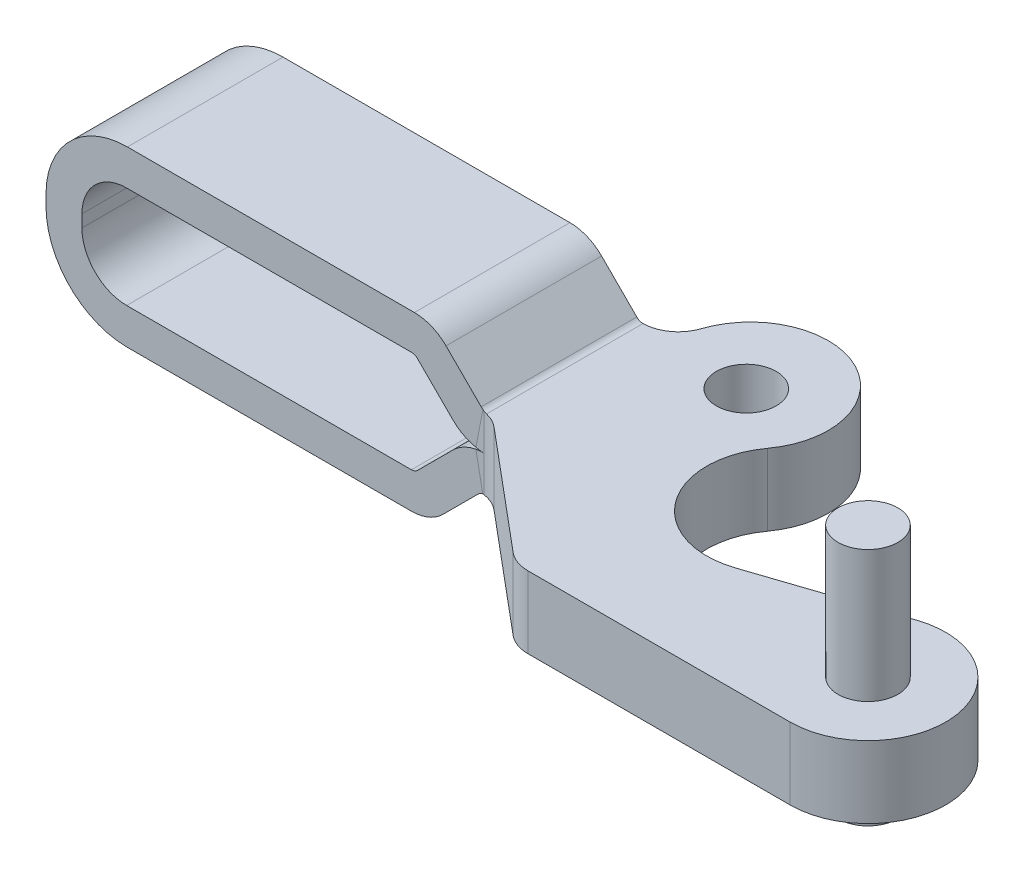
ISO-10303-21;
HEADER;
FILE_DESCRIPTION(('STEP AP214'),'2;1');
FILE_NAME('part.step','',(''),(''),'','','');
FILE_SCHEMA(('AUTOMOTIVE_DESIGN { 1 0 10303 214 1 1 1 1 }'));
ENDSEC;
DATA;
#1=APPLICATION_CONTEXT('core data for automotive mechanical design processes');
#2=APPLICATION_PROTOCOL_DEFINITION('international standard','automotive_design',2000,#1);
#3=PRODUCT_CONTEXT('',#1,'mechanical');
#4=PRODUCT('Part','Part','',(#3));
#5=PRODUCT_RELATED_PRODUCT_CATEGORY('part','',(#4));
#6=PRODUCT_DEFINITION_FORMATION('','',#4);
#7=PRODUCT_DEFINITION_CONTEXT('part definition',#1,'design');
#8=PRODUCT_DEFINITION('design','',#6,#7);
#9=PRODUCT_DEFINITION_SHAPE('','',#8);
#10=(LENGTH_UNIT() NAMED_UNIT(*) SI_UNIT(.MILLI.,.METRE.));
#11=(NAMED_UNIT(*) PLANE_ANGLE_UNIT() SI_UNIT($,.RADIAN.));
#12=(NAMED_UNIT(*) SI_UNIT($,.STERADIAN.) SOLID_ANGLE_UNIT());
#13=UNCERTAINTY_MEASURE_WITH_UNIT(LENGTH_MEASURE(1.E-05),#10,'distance_accuracy_value','');
#14=(GEOMETRIC_REPRESENTATION_CONTEXT(3) GLOBAL_UNCERTAINTY_ASSIGNED_CONTEXT((#13)) GLOBAL_UNIT_ASSIGNED_CONTEXT((#10,
#11,#12)) REPRESENTATION_CONTEXT('',''));
#15=CARTESIAN_POINT('',(0.,0.,0.));
#16=DIRECTION('',(0.,0.,1.));
#17=DIRECTION('',(1.,0.,0.));
#18=AXIS2_PLACEMENT_3D('',#15,#16,#17);
#19=CARTESIAN_POINT('',(-45.88752916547,7.25,-0.383671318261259));
#20=DIRECTION('',(0.000355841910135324,0.,0.999999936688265));
#21=DIRECTION('',(0.999999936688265,0.,-0.000355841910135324));
#22=AXIS2_PLACEMENT_3D('',#19,#20,#21);
#23=PLANE('',#22);
#24=DIRECTION('',(0.,1.,0.));
#25=VECTOR('',#24,1.);
#26=CARTESIAN_POINT('',(-42.8875293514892,-4.24999999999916,-0.38473884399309));
#27=LINE('',#26,#25);
#28=CARTESIAN_POINT('',(-42.8875293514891,-0.513399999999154,-0.38473884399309));
#29=VERTEX_POINT('',#28);
#30=CARTESIAN_POINT('',(-42.8875293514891,0.513400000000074,-0.38473884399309));
#31=VERTEX_POINT('',#30);
#32=EDGE_CURVE('E482',#29,#31,#27,.T.);
#33=ORIENTED_EDGE('',*,*,#32,.F.);
#34=CARTESIAN_POINT('',(-39.1509295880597,-0.513399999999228,-0.386068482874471));
#35=DIRECTION('',(0.000355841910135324,0.,0.999999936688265));
#36=DIRECTION('',(0.999999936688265,0.,-0.000355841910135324));
#37=AXIS2_PLACEMENT_3D('',#34,#35,#36);
#38=CIRCLE('',#37,3.7366);
#39=CARTESIAN_POINT('',(-39.1509295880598,-4.24999999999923,-0.38606848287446));
#40=VERTEX_POINT('',#39);
#41=EDGE_CURVE('E695',#29,#40,#38,.T.);
#42=ORIENTED_EDGE('',*,*,#41,.T.);
#43=DIRECTION('',(0.999999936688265,0.,-0.000355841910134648));
#44=VECTOR('',#43,1.);
#45=CARTESIAN_POINT('',(-9.57694067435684,-4.24999999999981,-0.396592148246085));
#46=LINE('',#45,#44);
#47=CARTESIAN_POINT('',(-15.3746907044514,-4.2499999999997,-0.394529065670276));
#48=VERTEX_POINT('',#47);
#49=EDGE_CURVE('E492',#40,#48,#46,.T.);
#50=ORIENTED_EDGE('',*,*,#49,.T.);
#51=CARTESIAN_POINT('',(-15.3746907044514,-3.51339999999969,-0.394529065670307));
#52=DIRECTION('',(0.000355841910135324,0.,0.999999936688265));
#53=DIRECTION('',(0.999999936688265,0.,-0.000355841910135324));
#54=AXIS2_PLACEMENT_3D('',#51,#52,#53);
#55=CIRCLE('',#54,0.7366);
#56=CARTESIAN_POINT('',(-14.8538358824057,-4.03425485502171,-0.394714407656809));
#57=VERTEX_POINT('',#56);
#58=EDGE_CURVE('E329',#48,#57,#55,.T.);
#59=ORIENTED_EDGE('',*,*,#58,.T.);
#60=DIRECTION('',(0.707106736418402,0.707106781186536,-0.000251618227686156));
#61=VECTOR('',#60,1.);
#62=CARTESIAN_POINT('',(-14.6038358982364,-3.78425485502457,-0.394803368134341));
#63=LINE('',#62,#61);
#64=CARTESIAN_POINT('',(-11.9140060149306,-1.09442480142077,-0.395760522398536));
#65=VERTEX_POINT('',#64);
#66=EDGE_CURVE('E545',#57,#65,#63,.T.);
#67=ORIENTED_EDGE('',*,*,#66,.T.);
#68=CARTESIAN_POINT('',(-9.27183098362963,-3.7366000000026,-0.396700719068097));
#69=DIRECTION('',(-0.000355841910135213,0.,-0.999999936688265));
#70=DIRECTION('',(-0.999999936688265,0.,0.000355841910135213));
#71=AXIS2_PLACEMENT_3D('',#68,#69,#70);
#72=CIRCLE('',#71,3.7366);
#73=CARTESIAN_POINT('',(-9.27183098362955,-2.20136409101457E-12,-0.396700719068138));
#74=VERTEX_POINT('',#73);
#75=EDGE_CURVE('E515',#74,#65,#72,.F.);
#76=ORIENTED_EDGE('',*,*,#75,.F.);
#77=CARTESIAN_POINT('',(-9.27183098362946,3.73659999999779,-0.396700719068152));
#78=DIRECTION('',(-0.000355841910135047,0.,-0.999999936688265));
#79=DIRECTION('',(-0.999999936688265,0.,0.000355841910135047));
#80=AXIS2_PLACEMENT_3D('',#77,#78,#79);
#81=CIRCLE('',#80,3.7366);
#82=CARTESIAN_POINT('',(-11.9140060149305,1.09442480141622,-0.395760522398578));
#83=VERTEX_POINT('',#82);
#84=EDGE_CURVE('E766',#83,#74,#81,.F.);
#85=ORIENTED_EDGE('',*,*,#84,.F.);
#86=DIRECTION('',(-0.707106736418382,0.707106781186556,0.000251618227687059));
#87=VECTOR('',#86,1.);
#88=CARTESIAN_POINT('',(-14.8195810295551,3.99999999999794,-0.394726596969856));
#89=LINE('',#88,#87);
#90=CARTESIAN_POINT('',(-14.8538358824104,4.03425485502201,-0.394714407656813));
#91=VERTEX_POINT('',#90);
#92=EDGE_CURVE('E498',#83,#91,#89,.T.);
#93=ORIENTED_EDGE('',*,*,#92,.T.);
#94=CARTESIAN_POINT('',(-15.3746907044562,3.5134,-0.394529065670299));
#95=DIRECTION('',(0.000355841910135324,0.,0.999999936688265));
#96=DIRECTION('',(0.999999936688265,0.,-0.000355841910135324));
#97=AXIS2_PLACEMENT_3D('',#94,#95,#96);
#98=CIRCLE('',#97,0.7366);
#99=CARTESIAN_POINT('',(-15.3746907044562,4.25,-0.394529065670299));
#100=VERTEX_POINT('',#99);
#101=EDGE_CURVE('E428',#91,#100,#98,.T.);
#102=ORIENTED_EDGE('',*,*,#101,.T.);
#103=DIRECTION('',(-0.999999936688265,0.,0.000355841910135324));
#104=VECTOR('',#103,1.);
#105=CARTESIAN_POINT('',(-45.88752916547,4.25,-0.383671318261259));
#106=LINE('',#105,#104);
#107=CARTESIAN_POINT('',(-39.1509295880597,4.25,-0.38606848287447));
#108=VERTEX_POINT('',#107);
#109=EDGE_CURVE('E480',#100,#108,#106,.T.);
#110=ORIENTED_EDGE('',*,*,#109,.T.);
#111=CARTESIAN_POINT('',(-39.1509295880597,0.5134,-0.386068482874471));
#112=DIRECTION('',(0.000355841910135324,0.,0.999999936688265));
#113=DIRECTION('',(0.999999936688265,0.,-0.000355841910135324));
#114=AXIS2_PLACEMENT_3D('',#111,#112,#113);
#115=CIRCLE('',#114,3.7366);
#116=EDGE_CURVE('E676',#108,#31,#115,.T.);
#117=ORIENTED_EDGE('',*,*,#116,.T.);
#118=EDGE_LOOP('',(#33,#42,#50,#59,#67,#76,#85,#93,#102,#110,#117));
#119=FACE_BOUND('',#118,.T.);
#120=DIRECTION('',(-0.999999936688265,0.,0.000355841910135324));
#121=VECTOR('',#120,1.);
#122=CARTESIAN_POINT('',(-45.88752916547,7.25,-0.383671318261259));
#123=LINE('',#122,#121);
#124=CARTESIAN_POINT('',(-15.124690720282,7.25,-0.394618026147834));
#125=VERTEX_POINT('',#124);
#126=CARTESIAN_POINT('',(-39.0875295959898,7.25,-0.38609104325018));
#127=VERTEX_POINT('',#126);
#128=EDGE_CURVE('E479',#125,#127,#123,.T.);
#129=ORIENTED_EDGE('',*,*,#128,.F.);
#130=CARTESIAN_POINT('',(-15.124690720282,3.5134,-0.394618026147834));
#131=DIRECTION('',(0.000355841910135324,0.,0.999999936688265));
#132=DIRECTION('',(0.999999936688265,0.,-0.000355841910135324));
#133=AXIS2_PLACEMENT_3D('',#130,#131,#132);
#134=CIRCLE('',#133,3.7366);
#135=CARTESIAN_POINT('',(-12.482515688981,6.15557519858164,-0.39555822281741));
#136=VERTEX_POINT('',#135);
#137=EDGE_CURVE('E653',#125,#136,#134,.F.);
#138=ORIENTED_EDGE('',*,*,#137,.T.);
#139=DIRECTION('',(-0.707106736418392,0.707106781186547,0.000251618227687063));
#140=VECTOR('',#139,1.);
#141=CARTESIAN_POINT('',(-29.7322347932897,23.405295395,-0.389420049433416));
#142=LINE('',#141,#140);
#143=CARTESIAN_POINT('',(-9.54268582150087,3.21574514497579,-0.396604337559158));
#144=VERTEX_POINT('',#143);
#145=EDGE_CURVE('E296',#136,#144,#142,.F.);
#146=ORIENTED_EDGE('',*,*,#145,.T.);
#147=CARTESIAN_POINT('',(-9.02183099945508,3.7365999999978,-0.396789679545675));
#148=DIRECTION('',(0.000355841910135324,0.,0.999999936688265));
#149=DIRECTION('',(0.999999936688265,0.,-0.000355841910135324));
#150=AXIS2_PLACEMENT_3D('',#147,#148,#149);
#151=CIRCLE('',#150,0.7366);
#152=CARTESIAN_POINT('',(-9.06401995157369,3.00120918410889,-0.396774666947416));
#153=VERTEX_POINT('',#152);
#154=EDGE_CURVE('E622',#144,#153,#151,.T.);
#155=ORIENTED_EDGE('',*,*,#154,.T.);
#156=DIRECTION('',(0.,1.,0.));
#157=VECTOR('',#156,1.);
#158=CARTESIAN_POINT('',(-9.0640199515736,7.24999999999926,-0.396774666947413));
#159=LINE('',#158,#157);
#160=CARTESIAN_POINT('',(-9.06401995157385,-3.0000000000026,-0.396774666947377));
#161=VERTEX_POINT('',#160);
#162=EDGE_CURVE('E608',#153,#161,#159,.F.);
#163=ORIENTED_EDGE('',*,*,#162,.T.);
#164=DIRECTION('',(0.999999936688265,0.,-0.000355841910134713));
#165=VECTOR('',#164,1.);
#166=CARTESIAN_POINT('',(-47.1501393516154,-3.00000000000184,-0.383222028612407));
#167=LINE('',#166,#165);
#168=CARTESIAN_POINT('',(-9.27183098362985,-3.00000000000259,-0.396700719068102));
#169=VERTEX_POINT('',#168);
#170=EDGE_CURVE('E514',#161,#169,#167,.F.);
#171=ORIENTED_EDGE('',*,*,#170,.T.);
#172=CARTESIAN_POINT('',(-9.27183098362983,-3.7366000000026,-0.39670071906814));
#173=DIRECTION('',(0.000355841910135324,0.,0.999999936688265));
#174=DIRECTION('',(0.999999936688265,0.,-0.000355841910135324));
#175=AXIS2_PLACEMENT_3D('',#172,#173,#174);
#176=CIRCLE('',#175,0.7366);
#177=CARTESIAN_POINT('',(-9.7926858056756,-3.21574514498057,-0.396515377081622));
#178=VERTEX_POINT('',#177);
#179=EDGE_CURVE('E625',#169,#178,#176,.T.);
#180=ORIENTED_EDGE('',*,*,#179,.T.);
#181=DIRECTION('',(0.707106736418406,0.707106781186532,-0.000251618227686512));
#182=VECTOR('',#181,1.);
#183=CARTESIAN_POINT('',(-9.57694067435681,-3.00000000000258,-0.396592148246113));
#184=LINE('',#183,#182);
#185=CARTESIAN_POINT('',(-12.7325156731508,-6.15557519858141,-0.395469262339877));
#186=VERTEX_POINT('',#185);
#187=EDGE_CURVE('E507',#186,#178,#184,.T.);
#188=ORIENTED_EDGE('',*,*,#187,.F.);
#189=CARTESIAN_POINT('',(-15.3746907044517,-3.51339999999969,-0.394529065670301));
#190=DIRECTION('',(0.000355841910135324,0.,0.999999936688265));
#191=DIRECTION('',(0.999999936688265,0.,-0.000355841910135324));
#192=AXIS2_PLACEMENT_3D('',#189,#190,#191);
#193=CIRCLE('',#192,3.7366);
#194=CARTESIAN_POINT('',(-15.3746907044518,-7.24999999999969,-0.394529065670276));
#195=VERTEX_POINT('',#194);
#196=EDGE_CURVE('E29',#186,#195,#193,.F.);
#197=ORIENTED_EDGE('',*,*,#196,.T.);
#198=DIRECTION('',(0.999999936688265,0.,-0.000355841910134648));
#199=VECTOR('',#198,1.);
#200=CARTESIAN_POINT('',(-9.5769406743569,-7.24999999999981,-0.396592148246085));
#201=LINE('',#200,#199);
#202=CARTESIAN_POINT('',(-39.0875295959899,-7.24999999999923,-0.38609104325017));
#203=VERTEX_POINT('',#202);
#204=EDGE_CURVE('E491',#203,#195,#201,.T.);
#205=ORIENTED_EDGE('',*,*,#204,.F.);
#206=CARTESIAN_POINT('',(-39.0875295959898,-0.449999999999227,-0.38609104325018));
#207=DIRECTION('',(0.000355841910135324,0.,0.999999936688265));
#208=DIRECTION('',(0.999999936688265,0.,-0.000355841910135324));
#209=AXIS2_PLACEMENT_3D('',#206,#207,#208);
#210=CIRCLE('',#209,6.8);
#211=CARTESIAN_POINT('',(-45.88752916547,-0.449999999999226,-0.383671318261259));
#212=VERTEX_POINT('',#211);
#213=EDGE_CURVE('E674',#203,#212,#210,.F.);
#214=ORIENTED_EDGE('',*,*,#213,.T.);
#215=DIRECTION('',(0.,-1.,0.));
#216=VECTOR('',#215,1.);
#217=CARTESIAN_POINT('',(-45.88752916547,7.25,-0.383671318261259));
#218=LINE('',#217,#216);
#219=CARTESIAN_POINT('',(-45.88752916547,0.449999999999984,-0.383671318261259));
#220=VERTEX_POINT('',#219);
#221=EDGE_CURVE('E463',#220,#212,#218,.T.);
#222=ORIENTED_EDGE('',*,*,#221,.F.);
#223=CARTESIAN_POINT('',(-39.0875295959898,0.449999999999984,-0.38609104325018));
#224=DIRECTION('',(0.000355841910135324,0.,0.999999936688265));
#225=DIRECTION('',(0.999999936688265,0.,-0.000355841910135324));
#226=AXIS2_PLACEMENT_3D('',#223,#224,#225);
#227=CIRCLE('',#226,6.8);
#228=EDGE_CURVE('E675',#220,#127,#227,.F.);
#229=ORIENTED_EDGE('',*,*,#228,.T.);
#230=EDGE_LOOP('',(#129,#138,#146,#155,#163,#171,#180,#188,#197,#205,#214,#222,#229));
#231=FACE_BOUND('',#230,.T.);
#232=ADVANCED_FACE('F14',(#119,#231),#23,.F.);
#233=CARTESIAN_POINT('',(-45.8829032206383,7.25,12.6163278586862));
#234=DIRECTION('',(0.999999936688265,0.,-0.000355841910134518));
#235=DIRECTION('',(-0.000355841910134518,0.,-0.999999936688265));
#236=AXIS2_PLACEMENT_3D('',#233,#234,#235);
#237=PLANE('',#236);
#238=ORIENTED_EDGE('',*,*,#221,.T.);
#239=DIRECTION('',(-0.000355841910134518,0.,-0.999999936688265));
#240=VECTOR('',#239,1.);
#241=CARTESIAN_POINT('',(-45.8829032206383,-0.449999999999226,12.6163278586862));
#242=LINE('',#241,#240);
#243=CARTESIAN_POINT('',(-45.8829032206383,-0.449999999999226,12.6163278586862));
#244=VERTEX_POINT('',#243);
#245=EDGE_CURVE('E687',#212,#244,#242,.F.);
#246=ORIENTED_EDGE('',*,*,#245,.T.);
#247=DIRECTION('',(0.,-1.,0.));
#248=VECTOR('',#247,1.);
#249=CARTESIAN_POINT('',(-45.8829032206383,7.25,12.6163278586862));
#250=LINE('',#249,#248);
#251=CARTESIAN_POINT('',(-45.8829032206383,0.449999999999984,12.6163278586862));
#252=VERTEX_POINT('',#251);
#253=EDGE_CURVE('E473',#252,#244,#250,.T.);
#254=ORIENTED_EDGE('',*,*,#253,.F.);
#255=DIRECTION('',(0.000355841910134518,0.,0.999999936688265));
#256=VECTOR('',#255,1.);
#257=CARTESIAN_POINT('',(-45.8829032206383,0.449999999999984,12.6163278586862));
#258=LINE('',#257,#256);
#259=EDGE_CURVE('E685',#252,#220,#258,.F.);
#260=ORIENTED_EDGE('',*,*,#259,.T.);
#261=EDGE_LOOP('',(#238,#246,#254,#260));
#262=FACE_BOUND('',#261,.T.);
#263=ADVANCED_FACE('F394',(#262),#237,.F.);
#264=CARTESIAN_POINT('',(-9.57231472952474,7.25,12.6034070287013));
#265=DIRECTION('',(-0.000355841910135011,0.,-0.999999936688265));
#266=DIRECTION('',(-0.999999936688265,0.,0.000355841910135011));
#267=AXIS2_PLACEMENT_3D('',#264,#265,#266);
#268=PLANE('',#267);
#269=DIRECTION('',(0.707106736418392,-0.707106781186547,-0.000251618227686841));
#270=VECTOR('',#269,1.);
#271=CARTESIAN_POINT('',(-11.5723146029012,5.25000000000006,12.6041187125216));
#272=LINE('',#271,#270);
#273=CARTESIAN_POINT('',(-9.53805987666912,3.21574514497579,12.6033948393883));
#274=VERTEX_POINT('',#273);
#275=CARTESIAN_POINT('',(-12.4778897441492,6.15557519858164,12.60444095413));
#276=VERTEX_POINT('',#275);
#277=EDGE_CURVE('E464',#274,#276,#272,.F.);
#278=ORIENTED_EDGE('',*,*,#277,.T.);
#279=CARTESIAN_POINT('',(-15.1200647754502,3.5134,12.6053811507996));
#280=DIRECTION('',(-0.000355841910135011,0.,-0.999999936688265));
#281=DIRECTION('',(-0.999999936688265,0.,0.000355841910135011));
#282=AXIS2_PLACEMENT_3D('',#279,#280,#281);
#283=CIRCLE('',#282,3.7366);
#284=CARTESIAN_POINT('',(-15.1200647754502,7.25,12.6053811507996));
#285=VERTEX_POINT('',#284);
#286=EDGE_CURVE('E643',#276,#285,#283,.F.);
#287=ORIENTED_EDGE('',*,*,#286,.T.);
#288=DIRECTION('',(0.999999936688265,0.,-0.000355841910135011));
#289=VECTOR('',#288,1.);
#290=CARTESIAN_POINT('',(-9.57231472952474,7.25,12.6034070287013));
#291=LINE('',#290,#289);
#292=CARTESIAN_POINT('',(-39.0829036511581,7.25,12.6139081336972));
#293=VERTEX_POINT('',#292);
#294=EDGE_CURVE('E476',#293,#285,#291,.T.);
#295=ORIENTED_EDGE('',*,*,#294,.F.);
#296=CARTESIAN_POINT('',(-39.0829036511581,0.449999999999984,12.6139081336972));
#297=DIRECTION('',(-0.000355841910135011,0.,-0.999999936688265));
#298=DIRECTION('',(-0.999999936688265,0.,0.000355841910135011));
#299=AXIS2_PLACEMENT_3D('',#296,#297,#298);
#300=CIRCLE('',#299,6.8);
#301=EDGE_CURVE('E671',#293,#252,#300,.F.);
#302=ORIENTED_EDGE('',*,*,#301,.T.);
#303=ORIENTED_EDGE('',*,*,#253,.T.);
#304=CARTESIAN_POINT('',(-39.0829036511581,-0.449999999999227,12.6139081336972));
#305=DIRECTION('',(-0.000355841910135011,0.,-0.999999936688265));
#306=DIRECTION('',(-0.999999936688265,0.,0.000355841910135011));
#307=AXIS2_PLACEMENT_3D('',#304,#305,#306);
#308=CIRCLE('',#307,6.8);
#309=CARTESIAN_POINT('',(-39.0829036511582,-7.24999999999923,12.6139081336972));
#310=VERTEX_POINT('',#309);
#311=EDGE_CURVE('E667',#244,#310,#308,.F.);
#312=ORIENTED_EDGE('',*,*,#311,.T.);
#313=DIRECTION('',(-0.999999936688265,0.,0.000355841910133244));
#314=VECTOR('',#313,1.);
#315=CARTESIAN_POINT('',(-45.8829032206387,-7.24999999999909,12.6163278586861));
#316=LINE('',#315,#314);
#317=CARTESIAN_POINT('',(-15.37006475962,-7.24999999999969,12.6054701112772));
#318=VERTEX_POINT('',#317);
#319=EDGE_CURVE('E494',#318,#310,#316,.T.);
#320=ORIENTED_EDGE('',*,*,#319,.F.);
#321=CARTESIAN_POINT('',(-15.37006475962,-3.51339999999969,12.6054701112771));
#322=DIRECTION('',(-0.000355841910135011,0.,-0.999999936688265));
#323=DIRECTION('',(-0.999999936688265,0.,0.000355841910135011));
#324=AXIS2_PLACEMENT_3D('',#321,#322,#323);
#325=CIRCLE('',#324,3.7366);
#326=CARTESIAN_POINT('',(-12.7278897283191,-6.15557519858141,12.6045299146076));
#327=VERTEX_POINT('',#326);
#328=EDGE_CURVE('E646',#318,#327,#325,.F.);
#329=ORIENTED_EDGE('',*,*,#328,.T.);
#330=DIRECTION('',(-0.707106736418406,-0.707106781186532,0.000251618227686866));
#331=VECTOR('',#330,1.);
#332=CARTESIAN_POINT('',(-9.57231472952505,-3.00000000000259,12.6034070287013));
#333=LINE('',#332,#331);
#334=CARTESIAN_POINT('',(-9.78805986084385,-3.21574514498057,12.6034837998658));
#335=VERTEX_POINT('',#334);
#336=EDGE_CURVE('E510',#335,#327,#333,.T.);
#337=ORIENTED_EDGE('',*,*,#336,.F.);
#338=CARTESIAN_POINT('',(-9.26720503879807,-3.7366000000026,12.6032984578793));
#339=DIRECTION('',(-0.000355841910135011,0.,-0.999999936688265));
#340=DIRECTION('',(-0.999999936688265,0.,0.000355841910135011));
#341=AXIS2_PLACEMENT_3D('',#338,#339,#340);
#342=CIRCLE('',#341,0.7366);
#343=CARTESIAN_POINT('',(-9.40802485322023,-3.01358593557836,12.6033485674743));
#344=VERTEX_POINT('',#343);
#345=EDGE_CURVE('E598',#335,#344,#342,.T.);
#346=ORIENTED_EDGE('',*,*,#345,.T.);
#347=DIRECTION('',(-0.191175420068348,0.981555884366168,6.80282309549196E-05));
#348=VECTOR('',#347,1.);
#349=CARTESIAN_POINT('',(-9.69478798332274,-1.54125210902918,12.6034506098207));
#350=LINE('',#349,#348);
#351=CARTESIAN_POINT('',(-9.98155111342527,-0.0689182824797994,12.6035526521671));
#352=VERTEX_POINT('',#351);
#353=EDGE_CURVE('E525',#344,#352,#350,.T.);
#354=ORIENTED_EDGE('',*,*,#353,.T.);
#355=CARTESIAN_POINT('',(-9.26720503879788,-3.7366000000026,12.6032984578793));
#356=DIRECTION('',(-0.000355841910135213,0.,-0.999999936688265));
#357=DIRECTION('',(-0.999999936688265,0.,0.000355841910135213));
#358=AXIS2_PLACEMENT_3D('',#355,#356,#357);
#359=CIRCLE('',#358,3.7366);
#360=CARTESIAN_POINT('',(-11.9093800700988,-1.09442480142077,12.6042386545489));
#361=VERTEX_POINT('',#360);
#362=EDGE_CURVE('E521',#361,#352,#359,.T.);
#363=ORIENTED_EDGE('',*,*,#362,.F.);
#364=DIRECTION('',(-0.707106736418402,-0.707106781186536,0.00025161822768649));
#365=VECTOR('',#364,1.);
#366=CARTESIAN_POINT('',(-11.9093800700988,-1.09442480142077,12.6042386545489));
#367=LINE('',#366,#365);
#368=CARTESIAN_POINT('',(-14.849209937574,-4.03425485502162,12.6052847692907));
#369=VERTEX_POINT('',#368);
#370=EDGE_CURVE('E520',#361,#369,#367,.T.);
#371=ORIENTED_EDGE('',*,*,#370,.T.);
#372=CARTESIAN_POINT('',(-15.3700647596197,-3.51339999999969,12.6054701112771));
#373=DIRECTION('',(-0.000355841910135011,0.,-0.999999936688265));
#374=DIRECTION('',(-0.999999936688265,0.,0.000355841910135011));
#375=AXIS2_PLACEMENT_3D('',#372,#373,#374);
#376=CIRCLE('',#375,0.7366);
#377=CARTESIAN_POINT('',(-15.3700647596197,-4.2499999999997,12.6054701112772));
#378=VERTEX_POINT('',#377);
#379=EDGE_CURVE('E436',#369,#378,#376,.T.);
#380=ORIENTED_EDGE('',*,*,#379,.T.);
#381=DIRECTION('',(-0.999999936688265,0.,0.000355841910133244));
#382=VECTOR('',#381,1.);
#383=CARTESIAN_POINT('',(-45.8829032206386,-4.2499999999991,12.6163278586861));
#384=LINE('',#383,#382);
#385=CARTESIAN_POINT('',(-39.1463036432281,-4.24999999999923,12.6139306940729));
#386=VERTEX_POINT('',#385);
#387=EDGE_CURVE('E495',#378,#386,#384,.T.);
#388=ORIENTED_EDGE('',*,*,#387,.T.);
#389=CARTESIAN_POINT('',(-39.146303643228,-0.513399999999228,12.613930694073));
#390=DIRECTION('',(-0.000355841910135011,0.,-0.999999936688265));
#391=DIRECTION('',(-0.999999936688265,0.,0.000355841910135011));
#392=AXIS2_PLACEMENT_3D('',#389,#390,#391);
#393=CIRCLE('',#392,3.7366);
#394=CARTESIAN_POINT('',(-42.8829034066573,-0.513399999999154,12.6152603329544));
#395=VERTEX_POINT('',#394);
#396=EDGE_CURVE('E697',#386,#395,#393,.T.);
#397=ORIENTED_EDGE('',*,*,#396,.T.);
#398=DIRECTION('',(0.,1.,0.));
#399=VECTOR('',#398,1.);
#400=CARTESIAN_POINT('',(-42.8829034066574,-4.24999999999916,12.6152603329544));
#401=LINE('',#400,#399);
#402=CARTESIAN_POINT('',(-42.8829034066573,0.513400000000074,12.6152603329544));
#403=VERTEX_POINT('',#402);
#404=EDGE_CURVE('E488',#395,#403,#401,.T.);
#405=ORIENTED_EDGE('',*,*,#404,.T.);
#406=CARTESIAN_POINT('',(-39.146303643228,0.5134,12.613930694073));
#407=DIRECTION('',(-0.000355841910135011,0.,-0.999999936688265));
#408=DIRECTION('',(-0.999999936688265,0.,0.000355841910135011));
#409=AXIS2_PLACEMENT_3D('',#406,#407,#408);
#410=CIRCLE('',#409,3.7366);
#411=CARTESIAN_POINT('',(-39.146303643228,4.25,12.613930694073));
#412=VERTEX_POINT('',#411);
#413=EDGE_CURVE('E680',#403,#412,#410,.T.);
#414=ORIENTED_EDGE('',*,*,#413,.T.);
#415=DIRECTION('',(0.999999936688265,0.,-0.000355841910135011));
#416=VECTOR('',#415,1.);
#417=CARTESIAN_POINT('',(-9.57231472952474,4.25,12.6034070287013));
#418=LINE('',#417,#416);
#419=CARTESIAN_POINT('',(-15.3700647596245,4.25,12.6054701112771));
#420=VERTEX_POINT('',#419);
#421=EDGE_CURVE('E477',#412,#420,#418,.T.);
#422=ORIENTED_EDGE('',*,*,#421,.T.);
#423=CARTESIAN_POINT('',(-15.3700647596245,3.5134,12.6054701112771));
#424=DIRECTION('',(-0.000355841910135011,0.,-0.999999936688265));
#425=DIRECTION('',(-0.999999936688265,0.,0.000355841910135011));
#426=AXIS2_PLACEMENT_3D('',#423,#424,#425);
#427=CIRCLE('',#426,0.7366);
#428=CARTESIAN_POINT('',(-14.8492099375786,4.03425485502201,12.6052847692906));
#429=VERTEX_POINT('',#428);
#430=EDGE_CURVE('E437',#420,#429,#427,.T.);
#431=ORIENTED_EDGE('',*,*,#430,.T.);
#432=DIRECTION('',(0.707106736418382,-0.707106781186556,-0.00025161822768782));
#433=VECTOR('',#432,1.);
#434=CARTESIAN_POINT('',(-14.8149550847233,3.99999999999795,12.6052725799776));
#435=LINE('',#434,#433);
#436=CARTESIAN_POINT('',(-11.9093800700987,1.09442480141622,12.6042386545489));
#437=VERTEX_POINT('',#436);
#438=EDGE_CURVE('E501',#429,#437,#435,.T.);
#439=ORIENTED_EDGE('',*,*,#438,.T.);
#440=CARTESIAN_POINT('',(-9.26720503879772,3.73659999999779,12.6032984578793));
#441=DIRECTION('',(-0.000355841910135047,0.,-0.999999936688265));
#442=DIRECTION('',(-0.999999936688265,0.,0.000355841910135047));
#443=AXIS2_PLACEMENT_3D('',#440,#441,#442);
#444=CIRCLE('',#443,3.7366);
#445=CARTESIAN_POINT('',(-9.98155111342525,0.0689182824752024,12.6035526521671));
#446=VERTEX_POINT('',#445);
#447=EDGE_CURVE('E767',#446,#437,#444,.T.);
#448=ORIENTED_EDGE('',*,*,#447,.F.);
#449=DIRECTION('',(0.191175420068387,0.981555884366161,-6.80282309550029E-05));
#450=VECTOR('',#449,1.);
#451=CARTESIAN_POINT('',(-9.98155111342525,0.0689182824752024,12.6035526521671));
#452=LINE('',#451,#450);
#453=CARTESIAN_POINT('',(-9.39084397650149,3.10179806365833,12.6033424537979));
#454=VERTEX_POINT('',#453);
#455=EDGE_CURVE('E295',#446,#454,#452,.T.);
#456=ORIENTED_EDGE('',*,*,#455,.T.);
#457=CARTESIAN_POINT('',(-9.01720505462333,3.7365999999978,12.6032094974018));
#458=DIRECTION('',(-0.000355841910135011,0.,-0.999999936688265));
#459=DIRECTION('',(-0.999999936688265,0.,0.000355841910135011));
#460=AXIS2_PLACEMENT_3D('',#457,#458,#459);
#461=CIRCLE('',#460,0.7366);
#462=EDGE_CURVE('E626',#454,#274,#461,.T.);
#463=ORIENTED_EDGE('',*,*,#462,.T.);
#464=EDGE_LOOP('',(#278,#287,#295,#302,#303,#312,#320,#329,#337,#346,#354,#363,#371,#380,#388,
#397,#405,#414,#422,#431,#439,#448,#456,#463));
#465=FACE_BOUND('',#464,.T.);
#466=ADVANCED_FACE('F401',(#465),#268,.F.);
#467=CARTESIAN_POINT('',(0.,7.25,0.));
#468=DIRECTION('',(0.,-1.,0.));
#469=DIRECTION('',(0.,0.,-1.));
#470=AXIS2_PLACEMENT_3D('',#467,#468,#469);
#471=PLANE('',#470);
#472=ORIENTED_EDGE('',*,*,#294,.T.);
#473=DIRECTION('',(-0.000355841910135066,0.,-0.999999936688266));
#474=VECTOR('',#473,1.);
#475=CARTESIAN_POINT('',(-15.1245483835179,7.25,0.00538194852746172));
#476=LINE('',#475,#474);
#477=EDGE_CURVE('E645',#285,#125,#476,.T.);
#478=ORIENTED_EDGE('',*,*,#477,.T.);
#479=ORIENTED_EDGE('',*,*,#128,.T.);
#480=DIRECTION('',(0.000355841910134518,0.,0.999999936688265));
#481=VECTOR('',#480,1.);
#482=CARTESIAN_POINT('',(-39.0873872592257,7.25,0.0139089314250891));
#483=LINE('',#482,#481);
#484=EDGE_CURVE('E652',#127,#293,#483,.T.);
#485=ORIENTED_EDGE('',*,*,#484,.T.);
#486=EDGE_LOOP('',(#472,#478,#479,#485));
#487=FACE_BOUND('',#486,.T.);
#488=ADVANCED_FACE('F650',(#487),#471,.F.);
#489=CARTESIAN_POINT('',(0.,4.25,0.));
#490=DIRECTION('',(0.,-1.,0.));
#491=DIRECTION('',(0.,0.,-1.));
#492=AXIS2_PLACEMENT_3D('',#489,#490,#491);
#493=PLANE('',#492);
#494=ORIENTED_EDGE('',*,*,#421,.F.);
#495=DIRECTION('',(0.000355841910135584,0.,0.999999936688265));
#496=VECTOR('',#495,1.);
#497=CARTESIAN_POINT('',(-39.1507872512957,4.25,0.0139314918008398));
#498=LINE('',#497,#496);
#499=EDGE_CURVE('E699',#412,#108,#498,.F.);
#500=ORIENTED_EDGE('',*,*,#499,.T.);
#501=ORIENTED_EDGE('',*,*,#109,.F.);
#502=DIRECTION('',(0.00035584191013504,0.,0.999999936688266));
#503=VECTOR('',#502,1.);
#504=CARTESIAN_POINT('',(-15.3700647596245,4.25,12.6054701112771));
#505=LINE('',#504,#503);
#506=EDGE_CURVE('E432',#100,#420,#505,.T.);
#507=ORIENTED_EDGE('',*,*,#506,.T.);
#508=EDGE_LOOP('',(#494,#500,#501,#507));
#509=FACE_BOUND('',#508,.T.);
#510=ADVANCED_FACE('F1107',(#509),#493,.T.);
#511=CARTESIAN_POINT('',(-42.8829034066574,-4.24999999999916,12.6152603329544));
#512=DIRECTION('',(-0.999999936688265,0.,0.000355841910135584));
#513=DIRECTION('',(0.000355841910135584,0.,0.999999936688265));
#514=AXIS2_PLACEMENT_3D('',#511,#512,#513);
#515=PLANE('',#514);
#516=ORIENTED_EDGE('',*,*,#404,.F.);
#517=DIRECTION('',(0.000355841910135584,0.,0.999999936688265));
#518=VECTOR('',#517,1.);
#519=CARTESIAN_POINT('',(-42.8829034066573,-0.513399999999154,12.6152603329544));
#520=LINE('',#519,#518);
#521=EDGE_CURVE('E701',#395,#29,#520,.F.);
#522=ORIENTED_EDGE('',*,*,#521,.T.);
#523=ORIENTED_EDGE('',*,*,#32,.T.);
#524=DIRECTION('',(0.000355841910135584,0.,0.999999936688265));
#525=VECTOR('',#524,1.);
#526=CARTESIAN_POINT('',(-42.8829034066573,0.513400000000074,12.6152603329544));
#527=LINE('',#526,#525);
#528=EDGE_CURVE('E703',#31,#403,#527,.T.);
#529=ORIENTED_EDGE('',*,*,#528,.T.);
#530=EDGE_LOOP('',(#516,#522,#523,#529));
#531=FACE_BOUND('',#530,.T.);
#532=ADVANCED_FACE('F1098',(#531),#515,.F.);
#533=CARTESIAN_POINT('',(-1.42532369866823E-13,-7.25,0.));
#534=DIRECTION('',(0.,1.,0.));
#535=DIRECTION('',(-1.,0.,0.));
#536=AXIS2_PLACEMENT_3D('',#533,#534,#535);
#537=PLANE('',#536);
#538=ORIENTED_EDGE('',*,*,#204,.T.);
#539=DIRECTION('',(0.000355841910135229,0.,0.999999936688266));
#540=VECTOR('',#539,1.);
#541=CARTESIAN_POINT('',(-15.37006475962,-7.24999999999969,12.6054701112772));
#542=LINE('',#541,#540);
#543=EDGE_CURVE('E22',#195,#318,#542,.T.);
#544=ORIENTED_EDGE('',*,*,#543,.T.);
#545=ORIENTED_EDGE('',*,*,#319,.T.);
#546=DIRECTION('',(-0.000355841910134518,0.,-0.999999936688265));
#547=VECTOR('',#546,1.);
#548=CARTESIAN_POINT('',(-39.0873872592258,-7.24999999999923,0.0139089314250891));
#549=LINE('',#548,#547);
#550=EDGE_CURVE('E673',#310,#203,#549,.T.);
#551=ORIENTED_EDGE('',*,*,#550,.T.);
#552=EDGE_LOOP('',(#538,#544,#545,#551));
#553=FACE_BOUND('',#552,.T.);
#554=ADVANCED_FACE('F662',(#553),#537,.F.);
#555=CARTESIAN_POINT('',(0.,-4.25,0.));
#556=DIRECTION('',(0.,1.,0.));
#557=DIRECTION('',(-1.,0.,0.));
#558=AXIS2_PLACEMENT_3D('',#555,#556,#557);
#559=PLANE('',#558);
#560=ORIENTED_EDGE('',*,*,#49,.F.);
#561=DIRECTION('',(0.000355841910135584,0.,0.999999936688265));
#562=VECTOR('',#561,1.);
#563=CARTESIAN_POINT('',(-39.1507872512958,-4.24999999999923,0.0139314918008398));
#564=LINE('',#563,#562);
#565=EDGE_CURVE('E705',#40,#386,#564,.T.);
#566=ORIENTED_EDGE('',*,*,#565,.T.);
#567=ORIENTED_EDGE('',*,*,#387,.F.);
#568=DIRECTION('',(0.000355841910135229,0.,0.999999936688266));
#569=VECTOR('',#568,1.);
#570=CARTESIAN_POINT('',(-15.3745483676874,-4.2499999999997,0.00547090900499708));
#571=LINE('',#570,#569);
#572=EDGE_CURVE('E452',#378,#48,#571,.F.);
#573=ORIENTED_EDGE('',*,*,#572,.T.);
#574=EDGE_LOOP('',(#560,#566,#567,#573));
#575=FACE_BOUND('',#574,.T.);
#576=ADVANCED_FACE('F1080',(#575),#559,.T.);
#577=CARTESIAN_POINT('',(-14.8211821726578,3.99999999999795,-4.89431744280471));
#578=DIRECTION('',(-0.707106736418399,-0.707106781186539,0.000251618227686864));
#579=DIRECTION('',(0.707106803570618,-0.707106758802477,0.));
#580=AXIS2_PLACEMENT_3D('',#577,#578,#579);
#581=PLANE('',#580);
#582=ORIENTED_EDGE('',*,*,#438,.F.);
#583=DIRECTION('',(0.00035584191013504,0.,0.999999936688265));
#584=VECTOR('',#583,1.);
#585=CARTESIAN_POINT('',(-14.8538358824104,4.03425485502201,-0.394714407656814));
#586=LINE('',#585,#584);
#587=EDGE_CURVE('E430',#429,#91,#586,.F.);
#588=ORIENTED_EDGE('',*,*,#587,.T.);
#589=ORIENTED_EDGE('',*,*,#92,.F.);
#590=DIRECTION('',(-0.000355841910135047,0.,-0.999999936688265));
#591=VECTOR('',#590,1.);
#592=CARTESIAN_POINT('',(-11.9068883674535,1.09442480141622,19.6065124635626));
#593=LINE('',#592,#591);
#594=EDGE_CURVE('E762',#437,#83,#593,.T.);
#595=ORIENTED_EDGE('',*,*,#594,.F.);
#596=EDGE_LOOP('',(#582,#588,#589,#595));
#597=FACE_BOUND('',#596,.T.);
#598=ADVANCED_FACE('F1071',(#597),#581,.T.);
#599=CARTESIAN_POINT('',(-9.57124720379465,-3.00000000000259,15.6034068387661));
#600=DIRECTION('',(0.707106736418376,-0.707106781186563,-0.000251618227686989));
#601=DIRECTION('',(0.707106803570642,0.707106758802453,0.));
#602=AXIS2_PLACEMENT_3D('',#599,#600,#601);
#603=PLANE('',#602);
#604=ORIENTED_EDGE('',*,*,#336,.T.);
#605=DIRECTION('',(0.000355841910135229,0.,0.999999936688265));
#606=VECTOR('',#605,1.);
#607=CARTESIAN_POINT('',(-12.7325156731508,-6.15557519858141,-0.395469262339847));
#608=LINE('',#607,#606);
#609=EDGE_CURVE('E9',#327,#186,#608,.F.);
#610=ORIENTED_EDGE('',*,*,#609,.T.);
#611=ORIENTED_EDGE('',*,*,#187,.T.);
#612=DIRECTION('',(-0.000355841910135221,0.,-0.999999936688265));
#613=VECTOR('',#612,1.);
#614=CARTESIAN_POINT('',(-9.78805986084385,-3.21574514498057,12.6034837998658));
#615=LINE('',#614,#613);
#616=EDGE_CURVE('E439',#178,#335,#615,.F.);
#617=ORIENTED_EDGE('',*,*,#616,.T.);
#618=EDGE_LOOP('',(#604,#610,#611,#617));
#619=FACE_BOUND('',#618,.T.);
#620=ADVANCED_FACE('F582',(#619),#603,.T.);
#621=CARTESIAN_POINT('',(-9.26719400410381,-0.0300000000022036,12.6343085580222));
#622=CARTESIAN_POINT('',(-9.50872105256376,-0.0300000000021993,12.6240573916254));
#623=CARTESIAN_POINT('',(-9.75021401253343,-0.00670173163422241,12.6138074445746));
#624=CARTESIAN_POINT('',(-9.9872863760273,0.039471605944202,12.603554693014));
#625=CARTESIAN_POINT('',(-9.26719400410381,-2.20136409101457E-12,12.6343085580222));
#626=CARTESIAN_POINT('',(-9.50679738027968,-2.19702728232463E-12,12.6240567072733));
#627=CARTESIAN_POINT('',(-9.74636694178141,0.0231127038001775,12.6138060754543));
#628=CARTESIAN_POINT('',(-9.98155111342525,0.0689182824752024,12.6035526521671));
#629=CARTESIAN_POINT('',(-9.26719400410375,2.9999999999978,12.6343085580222));
#630=CARTESIAN_POINT('',(-9.31443015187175,2.9999999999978,12.6239882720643));
#631=CARTESIAN_POINT('',(-9.36165986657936,3.00455624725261,12.6136691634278));
#632=CARTESIAN_POINT('',(-9.40802485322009,3.01358593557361,12.6033485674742));
#633=CARTESIAN_POINT('',(-9.26719400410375,3.0798701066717,12.6343085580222));
#634=CARTESIAN_POINT('',(-9.30930868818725,3.0798701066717,12.6239864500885));
#635=CARTESIAN_POINT('',(-9.35141766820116,3.08393231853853,12.6136655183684));
#636=CARTESIAN_POINT('',(-9.3927556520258,3.09198290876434,12.6033431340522));
#637=CARTESIAN_POINT('',(-9.26719400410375,3.11096880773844,12.6343085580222));
#638=CARTESIAN_POINT('',(-9.30731456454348,3.11096880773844,12.6239857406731));
#639=CARTESIAN_POINT('',(-9.34742970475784,3.11483865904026,12.6136640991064));
#640=CARTESIAN_POINT('',(-9.38681034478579,3.12250802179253,12.6033410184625));
#641=B_SPLINE_SURFACE_WITH_KNOTS('',1,3,((#621,#622,#623,#624),(#625,#626,#627,#628),(#629,#630,
#631,#632),(#633,#634,#635,#636),(#637,#638,#639,#640)),.UNSPECIFIED.,.F.,.F.,.F.,(2,1,1,1,2),
(4,4),(-0.01,0.,1.,1.0266233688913,1.03698960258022),(0.,1.),.UNSPECIFIED.);
#642=CARTESIAN_POINT('',(-9.26719400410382,-2.2065682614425E-12,12.6343085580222));
#643=CARTESIAN_POINT('',(-9.29714323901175,-7.47090633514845E-08,12.6330271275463));
#644=CARTESIAN_POINT('',(-9.327092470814,0.000360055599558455,12.6317456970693));
#645=CARTESIAN_POINT('',(-9.38697362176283,0.00180018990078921,12.6291828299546));
#646=CARTESIAN_POINT('',(-9.41690554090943,0.00288019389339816,12.627901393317));
#647=CARTESIAN_POINT('',(-9.47673476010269,0.00575953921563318,12.6253385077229));
#648=CARTESIAN_POINT('',(-9.50663206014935,0.00755888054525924,12.6240570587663));
#649=CARTESIAN_POINT('',(-9.56637475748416,0.0118758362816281,12.6214941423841));
#650=CARTESIAN_POINT('',(-9.59622015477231,0.014393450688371,12.6202126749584));
#651=CARTESIAN_POINT('',(-9.65584179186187,0.0201455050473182,12.6176497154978));
#652=CARTESIAN_POINT('',(-9.6856180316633,0.0233799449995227,12.616368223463));
#653=CARTESIAN_POINT('',(-9.74508414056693,0.0305637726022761,12.613805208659));
#654=CARTESIAN_POINT('',(-9.77477400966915,0.034513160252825,12.6125236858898));
#655=CARTESIAN_POINT('',(-9.83405020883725,0.0431246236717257,12.6099606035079));
#656=CARTESIAN_POINT('',(-9.86363653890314,0.0477866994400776,12.6086790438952));
#657=CARTESIAN_POINT('',(-9.92268857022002,0.057820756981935,12.6061158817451));
#658=CARTESIAN_POINT('',(-9.952154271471,0.0631927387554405,12.6048342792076));
#659=CARTESIAN_POINT('',(-9.98155111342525,0.0689182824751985,12.6035526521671));
#660=B_SPLINE_CURVE_WITH_KNOTS('',3,(#642,#643,#644,#645,#646,#647,#648,#649,#650,#651,#652,
#653,#654,#655,#656,#657,#658,#659),.UNSPECIFIED.,.F.,.F.,(4,2,2,2,2,2,2,2,4),(0.,
0.0899277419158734,0.179855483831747,0.269783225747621,0.359710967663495,0.449638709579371,
0.539566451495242,0.629494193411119,0.719421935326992),.UNSPECIFIED.);
#661=CARTESIAN_POINT('',(-9.26719400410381,-2.20136409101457E-12,12.6343085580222));
#662=VERTEX_POINT('',#661);
#663=EDGE_CURVE('E290',#446,#662,#660,.F.);
#664=DIRECTION('',(0.,1.,0.));
#665=VECTOR('',#664,1.);
#666=CARTESIAN_POINT('',(-9.26719400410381,-2.20136409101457E-12,12.6343085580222));
#667=LINE('',#666,#665);
#668=CARTESIAN_POINT('',(-9.26719400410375,3.04372226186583,12.6343085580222));
#669=VERTEX_POINT('',#668);
#670=EDGE_CURVE('E638',#662,#669,#667,.T.);
#671=CARTESIAN_POINT('',(-9.26719400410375,3.04372226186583,12.6343085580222));
#672=CARTESIAN_POINT('',(-9.28859612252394,3.05144177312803,12.6293372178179));
#673=CARTESIAN_POINT('',(-9.3096138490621,3.06014741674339,12.6242883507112));
#674=CARTESIAN_POINT('',(-9.34051884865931,3.07465194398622,12.6165661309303));
#675=CARTESIAN_POINT('',(-9.3507538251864,3.07974949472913,12.6139572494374));
#676=CARTESIAN_POINT('',(-9.37098745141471,3.09042087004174,12.6086878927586));
#677=CARTESIAN_POINT('',(-9.38098556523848,3.09599566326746,12.6060273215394));
#678=CARTESIAN_POINT('',(-9.39084397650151,3.10179806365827,12.6033424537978));
#679=B_SPLINE_CURVE_WITH_KNOTS('',3,(#671,#672,#673,#674,#675,#676,#677,#678),.UNSPECIFIED.,.F.,
.F.,(4,2,2,4),(0.,0.0698197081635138,0.104992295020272,0.140238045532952),.UNSPECIFIED.);
#680=EDGE_CURVE('E328',#669,#454,#679,.T.);
#681=ORIENTED_EDGE('',*,*,#455,.F.);
#682=ORIENTED_EDGE('',*,*,#663,.T.);
#683=ORIENTED_EDGE('',*,*,#670,.T.);
#684=ORIENTED_EDGE('',*,*,#680,.T.);
#685=EDGE_LOOP('',(#681,#682,#683,#684));
#686=FACE_BOUND('',#685,.T.);
#687=ADVANCED_FACE('F315',(#686),#641,.T.);
#688=CARTESIAN_POINT('',(-9.69636880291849,-2.19269047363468E-12,15.6034513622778));
#689=DIRECTION('',(0.,1.,0.));
#690=DIRECTION('',(0.999999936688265,0.,-0.000355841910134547));
#691=AXIS2_PLACEMENT_3D('',#688,#689,#690);
#692=CYLINDRICAL_SURFACE('',#691,3.);
#693=ORIENTED_EDGE('',*,*,#670,.F.);
#694=DIRECTION('',(0.,1.,0.));
#695=VECTOR('',#694,1.);
#696=CARTESIAN_POINT('',(-9.26719400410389,-3.0000000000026,12.6343085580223));
#697=LINE('',#696,#695);
#698=CARTESIAN_POINT('',(-9.26719400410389,-3.0000000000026,12.6343085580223));
#699=VERTEX_POINT('',#698);
#700=EDGE_CURVE('E530',#699,#662,#697,.T.);
#701=ORIENTED_EDGE('',*,*,#700,.F.);
#702=CARTESIAN_POINT('',(-9.69636880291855,-3.00000000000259,15.6034513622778));
#703=DIRECTION('',(0.,1.,0.));
#704=DIRECTION('',(0.999999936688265,0.,-0.000355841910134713));
#705=AXIS2_PLACEMENT_3D('',#702,#703,#704);
#706=CIRCLE('',#705,3.);
#707=CARTESIAN_POINT('',(-7.7688238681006,-3.00000000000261,13.3046319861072));
#708=VERTEX_POINT('',#707);
#709=EDGE_CURVE('E526',#708,#699,#706,.T.);
#710=ORIENTED_EDGE('',*,*,#709,.F.);
#711=DIRECTION('',(0.,1.,0.));
#712=VECTOR('',#711,1.);
#713=CARTESIAN_POINT('',(-7.76882386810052,-2.21697660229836E-12,13.3046319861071));
#714=LINE('',#713,#712);
#715=CARTESIAN_POINT('',(-7.76882386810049,2.99999999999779,13.3046319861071));
#716=VERTEX_POINT('',#715);
#717=EDGE_CURVE('E272',#716,#708,#714,.F.);
#718=ORIENTED_EDGE('',*,*,#717,.F.);
#719=CARTESIAN_POINT('',(-9.69636880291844,2.99999999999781,15.6034513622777));
#720=DIRECTION('',(0.,1.,0.));
#721=DIRECTION('',(0.999999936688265,0.,-0.000355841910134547));
#722=AXIS2_PLACEMENT_3D('',#719,#720,#721);
#723=CIRCLE('',#722,3.);
#724=CARTESIAN_POINT('',(-9.01717725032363,2.9999999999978,12.681346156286));
#725=VERTEX_POINT('',#724);
#726=EDGE_CURVE('E831',#725,#716,#723,.F.);
#727=ORIENTED_EDGE('',*,*,#726,.F.);
#728=CARTESIAN_POINT('',(-9.01717725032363,2.9999999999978,12.681346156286));
#729=CARTESIAN_POINT('',(-9.03831894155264,2.99999731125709,12.676429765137));
#730=CARTESIAN_POINT('',(-9.05951667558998,3.00091012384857,12.6717469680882));
#731=CARTESIAN_POINT('',(-9.1016913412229,3.0045606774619,12.6629044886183));
#732=CARTESIAN_POINT('',(-9.12266871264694,3.00728425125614,12.6587410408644));
#733=CARTESIAN_POINT('',(-9.16440271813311,3.01455020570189,12.6509163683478));
#734=CARTESIAN_POINT('',(-9.18515934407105,3.01909265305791,12.6472551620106));
#735=CARTESIAN_POINT('',(-9.22643981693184,3.03001995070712,12.6404104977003));
#736=CARTESIAN_POINT('',(-9.24696058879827,3.03641888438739,12.6372309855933));
#737=CARTESIAN_POINT('',(-9.26719400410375,3.04372226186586,12.6343085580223));
#738=B_SPLINE_CURVE_WITH_KNOTS('',3,(#728,#729,#730,#731,#732,#733,#734,#735,#736,#737),
.UNSPECIFIED.,.F.,.F.,(4,2,2,2,4),(0.,0.0650993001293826,0.129695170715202,0.194293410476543,
0.259395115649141),.UNSPECIFIED.);
#739=EDGE_CURVE('E319',#725,#669,#738,.T.);
#740=ORIENTED_EDGE('',*,*,#739,.T.);
#741=EDGE_LOOP('',(#693,#701,#710,#718,#727,#740));
#742=FACE_BOUND('',#741,.T.);
#743=ADVANCED_FACE('F310',(#742),#692,.F.);
#744=CARTESIAN_POINT('',(-7.76882386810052,-2.21697660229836E-12,13.3046319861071));
#745=DIRECTION('',(-0.642514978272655,0.,0.766273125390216));
#746=DIRECTION('',(0.766273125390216,0.,0.642514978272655));
#747=AXIS2_PLACEMENT_3D('',#744,#745,#746);
#748=PLANE('',#747);
#749=DIRECTION('',(-0.766273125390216,0.,-0.642514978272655));
#750=VECTOR('',#749,1.);
#751=CARTESIAN_POINT('',(2.12123326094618,-3.0000000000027,21.5973798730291));
#752=LINE('',#751,#750);
#753=CARTESIAN_POINT('',(2.12123326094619,-3.0000000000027,21.5973798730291));
#754=VERTEX_POINT('',#753);
#755=EDGE_CURVE('E468',#754,#708,#752,.T.);
#756=ORIENTED_EDGE('',*,*,#755,.F.);
#757=DIRECTION('',(0.,-1.,0.));
#758=VECTOR('',#757,1.);
#759=CARTESIAN_POINT('',(2.12123326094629,-2.41213302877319E-12,21.5973798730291));
#760=LINE('',#759,#758);
#761=CARTESIAN_POINT('',(2.12123326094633,2.99999999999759,21.5973798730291));
#762=VERTEX_POINT('',#761);
#763=EDGE_CURVE('E603',#754,#762,#760,.F.);
#764=ORIENTED_EDGE('',*,*,#763,.T.);
#765=DIRECTION('',(0.766273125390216,0.,0.642514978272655));
#766=VECTOR('',#765,1.);
#767=CARTESIAN_POINT('',(-7.76882386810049,2.99999999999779,13.3046319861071));
#768=LINE('',#767,#766);
#769=EDGE_CURVE('E265',#762,#716,#768,.F.);
#770=ORIENTED_EDGE('',*,*,#769,.T.);
#771=ORIENTED_EDGE('',*,*,#717,.T.);
#772=EDGE_LOOP('',(#756,#764,#770,#771));
#773=FACE_BOUND('',#772,.T.);
#774=ADVANCED_FACE('F314',(#773),#748,.T.);
#775=CARTESIAN_POINT('',(25.9579336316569,-2.93775420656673E-12,22.2907644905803));
#776=DIRECTION('',(0.000355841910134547,0.,0.999999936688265));
#777=DIRECTION('',(0.,-1.,0.));
#778=AXIS2_PLACEMENT_3D('',#775,#776,#777);
#779=PLANE('',#778);
#780=DIRECTION('',(0.999999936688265,0.,-0.000355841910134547));
#781=VECTOR('',#780,1.);
#782=CARTESIAN_POINT('',(25.957933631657,2.99999999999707,22.2907644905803));
#783=LINE('',#782,#781);
#784=CARTESIAN_POINT('',(25.957933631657,2.99999999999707,22.2907644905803));
#785=VERTEX_POINT('',#784);
#786=CARTESIAN_POINT('',(4.04984572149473,2.9999999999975,22.2985603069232));
#787=VERTEX_POINT('',#786);
#788=EDGE_CURVE('E237',#785,#787,#783,.F.);
#789=ORIENTED_EDGE('',*,*,#788,.T.);
#790=DIRECTION('',(0.,-1.,0.));
#791=VECTOR('',#790,1.);
#792=CARTESIAN_POINT('',(4.04984572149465,-2.50545092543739E-12,22.2985603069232));
#793=LINE('',#792,#791);
#794=CARTESIAN_POINT('',(4.04984572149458,-3.00000000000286,22.2985603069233));
#795=VERTEX_POINT('',#794);
#796=EDGE_CURVE('E597',#787,#795,#793,.T.);
#797=ORIENTED_EDGE('',*,*,#796,.T.);
#798=DIRECTION('',(-0.999999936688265,0.,0.000355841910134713));
#799=VECTOR('',#798,1.);
#800=CARTESIAN_POINT('',(-9.69398466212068,-3.00000000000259,22.3034509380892));
#801=LINE('',#800,#799);
#802=CARTESIAN_POINT('',(25.9579336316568,-3.00000000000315,22.2907644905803));
#803=VERTEX_POINT('',#802);
#804=EDGE_CURVE('E263',#803,#795,#801,.T.);
#805=ORIENTED_EDGE('',*,*,#804,.F.);
#806=DIRECTION('',(0.,-1.,0.));
#807=VECTOR('',#806,1.);
#808=CARTESIAN_POINT('',(25.9579336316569,-2.93775420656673E-12,22.2907644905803));
#809=LINE('',#808,#807);
#810=EDGE_CURVE('E250',#803,#785,#809,.F.);
#811=ORIENTED_EDGE('',*,*,#810,.T.);
#812=EDGE_LOOP('',(#789,#797,#805,#811));
#813=FACE_BOUND('',#812,.T.);
#814=ADVANCED_FACE('F261',(#813),#779,.T.);
#815=CARTESIAN_POINT('',(25.9556206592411,-2.93775420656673E-12,15.7907649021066));
#816=DIRECTION('',(0.,1.,0.));
#817=DIRECTION('',(0.999999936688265,0.,-0.000355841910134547));
#818=AXIS2_PLACEMENT_3D('',#815,#816,#817);
#819=CYLINDRICAL_SURFACE('',#818,6.5);
#820=CARTESIAN_POINT('',(25.9556206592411,2.99999999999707,15.7907649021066));
#821=DIRECTION('',(0.,1.,0.));
#822=DIRECTION('',(0.999999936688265,0.,-0.000355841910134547));
#823=AXIS2_PLACEMENT_3D('',#820,#821,#822);
#824=CIRCLE('',#823,6.5);
#825=CARTESIAN_POINT('',(23.8972680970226,2.99999999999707,9.62528156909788));
#826=VERTEX_POINT('',#825);
#827=EDGE_CURVE('E241',#826,#785,#824,.F.);
#828=ORIENTED_EDGE('',*,*,#827,.T.);
#829=ORIENTED_EDGE('',*,*,#810,.F.);
#830=CARTESIAN_POINT('',(25.9556206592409,-3.00000000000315,15.7907649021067));
#831=DIRECTION('',(0.,1.,0.));
#832=DIRECTION('',(0.999999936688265,0.,-0.000355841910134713));
#833=AXIS2_PLACEMENT_3D('',#830,#831,#832);
#834=CIRCLE('',#833,6.5);
#835=CARTESIAN_POINT('',(23.8972680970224,-3.00000000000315,9.62528156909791));
#836=VERTEX_POINT('',#835);
#837=EDGE_CURVE('E539',#836,#803,#834,.F.);
#838=ORIENTED_EDGE('',*,*,#837,.F.);
#839=DIRECTION('',(0.,1.,0.));
#840=VECTOR('',#839,1.);
#841=CARTESIAN_POINT('',(23.8972680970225,-2.9394889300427E-12,9.62528156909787));
#842=LINE('',#841,#840);
#843=EDGE_CURVE('E257',#836,#826,#842,.T.);
#844=ORIENTED_EDGE('',*,*,#843,.T.);
#845=EDGE_LOOP('',(#828,#829,#838,#844));
#846=FACE_BOUND('',#845,.T.);
#847=ADVANCED_FACE('F254',(#846),#819,.T.);
#848=CARTESIAN_POINT('',(12.5109370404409,-2.617697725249E-12,13.4266191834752));
#849=DIRECTION('',(-0.316669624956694,0.,-0.948535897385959));
#850=DIRECTION('',(-0.948535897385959,0.,0.316669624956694));
#851=AXIS2_PLACEMENT_3D('',#848,#849,#850);
#852=PLANE('',#851);
#853=ORIENTED_EDGE('',*,*,#843,.F.);
#854=DIRECTION('',(0.948535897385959,0.,-0.316669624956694));
#855=VECTOR('',#854,1.);
#856=CARTESIAN_POINT('',(12.5109370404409,-3.00000000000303,13.4266191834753));
#857=LINE('',#856,#855);
#858=CARTESIAN_POINT('',(12.5109370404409,-3.00000000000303,13.4266191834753));
#859=VERTEX_POINT('',#858);
#860=EDGE_CURVE('E538',#859,#836,#857,.T.);
#861=ORIENTED_EDGE('',*,*,#860,.F.);
#862=DIRECTION('',(0.,1.,0.));
#863=VECTOR('',#862,1.);
#864=CARTESIAN_POINT('',(12.5109370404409,-2.617697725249E-12,13.4266191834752));
#865=LINE('',#864,#863);
#866=CARTESIAN_POINT('',(12.510937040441,2.99999999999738,13.4266191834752));
#867=VERTEX_POINT('',#866);
#868=EDGE_CURVE('E279',#859,#867,#865,.T.);
#869=ORIENTED_EDGE('',*,*,#868,.T.);
#870=DIRECTION('',(-0.948535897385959,0.,0.316669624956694));
#871=VECTOR('',#870,1.);
#872=CARTESIAN_POINT('',(12.510937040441,2.99999999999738,13.4266191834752));
#873=LINE('',#872,#871);
#874=EDGE_CURVE('E283',#867,#826,#873,.F.);
#875=ORIENTED_EDGE('',*,*,#874,.T.);
#876=EDGE_LOOP('',(#853,#861,#869,#875));
#877=FACE_BOUND('',#876,.T.);
#878=ADVANCED_FACE('F1011',(#877),#852,.T.);
#879=CARTESIAN_POINT('',(10.4525844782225,-2.59080951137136E-12,7.26113585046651));
#880=DIRECTION('',(0.,1.,0.));
#881=DIRECTION('',(0.999999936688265,0.,-0.000355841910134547));
#882=AXIS2_PLACEMENT_3D('',#879,#880,#881);
#883=CYLINDRICAL_SURFACE('',#882,6.5);
#884=ORIENTED_EDGE('',*,*,#868,.F.);
#885=CARTESIAN_POINT('',(10.4525844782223,-3.00000000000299,7.26113585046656));
#886=DIRECTION('',(0.,1.,0.));
#887=DIRECTION('',(0.999999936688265,0.,-0.000355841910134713));
#888=AXIS2_PLACEMENT_3D('',#885,#886,#887);
#889=CIRCLE('',#888,6.5);
#890=CARTESIAN_POINT('',(5.20122107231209,-3.00000000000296,3.43057683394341));
#891=VERTEX_POINT('',#890);
#892=EDGE_CURVE('E534',#891,#859,#889,.T.);
#893=ORIENTED_EDGE('',*,*,#892,.F.);
#894=DIRECTION('',(0.,1.,0.));
#895=VECTOR('',#894,1.);
#896=CARTESIAN_POINT('',(5.20122107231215,-2.55611504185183E-12,3.43057683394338));
#897=LINE('',#896,#895);
#898=CARTESIAN_POINT('',(5.20122107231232,2.99999999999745,3.43057683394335));
#899=VERTEX_POINT('',#898);
#900=EDGE_CURVE('E284',#899,#891,#897,.F.);
#901=ORIENTED_EDGE('',*,*,#900,.F.);
#902=CARTESIAN_POINT('',(10.4525844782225,2.99999999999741,7.26113585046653));
#903=DIRECTION('',(0.,1.,0.));
#904=DIRECTION('',(0.999999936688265,0.,-0.000355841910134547));
#905=AXIS2_PLACEMENT_3D('',#902,#903,#904);
#906=CIRCLE('',#905,6.5);
#907=EDGE_CURVE('E288',#867,#899,#906,.F.);
#908=ORIENTED_EDGE('',*,*,#907,.F.);
#909=EDGE_LOOP('',(#884,#893,#901,#908));
#910=FACE_BOUND('',#909,.T.);
#911=ADVANCED_FACE('F718',(#910),#883,.F.);
#912=CARTESIAN_POINT('',(-0.0501423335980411,-2.50841014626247E-12,-0.399982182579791));
#913=DIRECTION('',(0.,1.,0.));
#914=DIRECTION('',(0.999999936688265,0.,-0.000355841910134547));
#915=AXIS2_PLACEMENT_3D('',#912,#913,#914);
#916=CYLINDRICAL_SURFACE('',#915,6.5);
#917=CARTESIAN_POINT('',(-0.0501423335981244,-3.0000000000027,-0.399982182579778));
#918=DIRECTION('',(0.,1.,0.));
#919=DIRECTION('',(0.999999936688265,0.,-0.000355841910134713));
#920=AXIS2_PLACEMENT_3D('',#917,#918,#919);
#921=CIRCLE('',#920,6.5);
#922=CARTESIAN_POINT('',(-6.21826269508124,-3.00000000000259,-2.45041901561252));
#923=VERTEX_POINT('',#922);
#924=EDGE_CURVE('E531',#923,#891,#921,.F.);
#925=ORIENTED_EDGE('',*,*,#924,.F.);
#926=DIRECTION('',(0.,1.,0.));
#927=VECTOR('',#926,1.);
#928=CARTESIAN_POINT('',(-6.21826269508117,-2.38669716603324E-12,-2.4504190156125));
#929=LINE('',#928,#927);
#930=CARTESIAN_POINT('',(-6.21826269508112,2.99999999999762,-2.45041901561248));
#931=VERTEX_POINT('',#930);
#932=EDGE_CURVE('E606',#923,#931,#929,.T.);
#933=ORIENTED_EDGE('',*,*,#932,.T.);
#934=CARTESIAN_POINT('',(-0.0501423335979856,2.9999999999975,-0.399982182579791));
#935=DIRECTION('',(0.,1.,0.));
#936=DIRECTION('',(0.999999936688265,0.,-0.000355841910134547));
#937=AXIS2_PLACEMENT_3D('',#934,#935,#936);
#938=CIRCLE('',#937,6.5);
#939=EDGE_CURVE('E289',#931,#899,#938,.F.);
#940=ORIENTED_EDGE('',*,*,#939,.T.);
#941=ORIENTED_EDGE('',*,*,#900,.T.);
#942=EDGE_LOOP('',(#925,#933,#940,#941));
#943=FACE_BOUND('',#942,.T.);
#944=ADVANCED_FACE('F307',(#943),#916,.T.);
#945=CARTESIAN_POINT('',(-9.26471333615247,3.73659999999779,19.605572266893));
#946=DIRECTION('',(-0.000355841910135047,0.,-0.999999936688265));
#947=DIRECTION('',(-0.999999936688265,0.,0.000355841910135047));
#948=AXIS2_PLACEMENT_3D('',#945,#946,#947);
#949=CYLINDRICAL_SURFACE('',#948,3.7366);
#950=ORIENTED_EDGE('',*,*,#84,.T.);
#951=DIRECTION('',(-0.000355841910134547,0.,-0.999999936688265));
#952=VECTOR('',#951,1.);
#953=CARTESIAN_POINT('',(-9.26613751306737,-2.20136409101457E-12,15.6032982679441));
#954=LINE('',#953,#952);
#955=EDGE_CURVE('E504',#662,#74,#954,.T.);
#956=ORIENTED_EDGE('',*,*,#955,.F.);
#957=ORIENTED_EDGE('',*,*,#663,.F.);
#958=ORIENTED_EDGE('',*,*,#447,.T.);
#959=ORIENTED_EDGE('',*,*,#594,.T.);
#960=EDGE_LOOP('',(#950,#956,#957,#958,#959));
#961=FACE_BOUND('',#960,.T.);
#962=ADVANCED_FACE('F297',(#961),#949,.T.);
#963=CARTESIAN_POINT('',(-9.69636880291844,2.99999999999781,15.6034513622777));
#964=DIRECTION('',(0.,-1.,0.));
#965=DIRECTION('',(-0.999999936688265,0.,0.000355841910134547));
#966=AXIS2_PLACEMENT_3D('',#963,#964,#965);
#967=PLANE('',#966);
#968=CARTESIAN_POINT('',(3.55186591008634E-13,2.99999999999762,0.));
#969=DIRECTION('',(0.,-1.,0.));
#970=DIRECTION('',(1.,0.,0.));
#971=AXIS2_PLACEMENT_3D('',#968,#969,#970);
#972=CIRCLE('',#971,2.5);
#973=CARTESIAN_POINT('',(2.50000000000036,2.99999999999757,0.));
#974=VERTEX_POINT('',#973);
#975=EDGE_CURVE('E1384',#974,#974,#972,.T.);
#976=ORIENTED_EDGE('',*,*,#975,.T.);
#977=EDGE_LOOP('',(#976));
#978=FACE_BOUND('',#977,.T.);
#979=CARTESIAN_POINT('',(25.955620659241,2.99999999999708,15.7907649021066));
#980=DIRECTION('',(0.,1.,0.));
#981=DIRECTION('',(-1.,0.,0.));
#982=AXIS2_PLACEMENT_3D('',#979,#980,#981);
#983=CIRCLE('',#982,2.5);
#984=CARTESIAN_POINT('',(23.455620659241,2.9999999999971,15.7907649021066));
#985=VERTEX_POINT('',#984);
#986=EDGE_CURVE('E1378',#985,#985,#983,.T.);
#987=ORIENTED_EDGE('',*,*,#986,.F.);
#988=EDGE_LOOP('',(#987));
#989=FACE_BOUND('',#988,.T.);
#990=ORIENTED_EDGE('',*,*,#769,.F.);
#991=CARTESIAN_POINT('',(4.04877819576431,2.99999999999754,19.2985604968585));
#992=DIRECTION('',(0.,-1.,0.));
#993=DIRECTION('',(1.,0.,0.));
#994=AXIS2_PLACEMENT_3D('',#991,#992,#993);
#995=CIRCLE('',#994,3.);
#996=EDGE_CURVE('E244',#762,#787,#995,.F.);
#997=ORIENTED_EDGE('',*,*,#996,.T.);
#998=ORIENTED_EDGE('',*,*,#788,.F.);
#999=ORIENTED_EDGE('',*,*,#827,.F.);
#1000=ORIENTED_EDGE('',*,*,#874,.F.);
#1001=ORIENTED_EDGE('',*,*,#907,.T.);
#1002=ORIENTED_EDGE('',*,*,#939,.F.);
#1003=CARTESIAN_POINT('',(-9.0650874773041,2.9999999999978,-3.39677447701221));
#1004=DIRECTION('',(0.,-1.,0.));
#1005=DIRECTION('',(1.,0.,0.));
#1006=AXIS2_PLACEMENT_3D('',#1003,#1004,#1005);
#1007=CIRCLE('',#1006,3.);
#1008=CARTESIAN_POINT('',(-9.02183110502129,2.9999999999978,-0.397086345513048));
#1009=VERTEX_POINT('',#1008);
#1010=EDGE_CURVE('E359',#931,#1009,#1007,.T.);
#1011=ORIENTED_EDGE('',*,*,#1010,.T.);
#1012=DIRECTION('',(-0.000355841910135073,0.,-0.999999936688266));
#1013=VECTOR('',#1012,1.);
#1014=CARTESIAN_POINT('',(-9.01719830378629,2.9999999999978,12.6221809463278));
#1015=LINE('',#1014,#1013);
#1016=EDGE_CURVE('E449',#1009,#725,#1015,.F.);
#1017=ORIENTED_EDGE('',*,*,#1016,.T.);
#1018=ORIENTED_EDGE('',*,*,#726,.T.);
#1019=EDGE_LOOP('',(#990,#997,#998,#999,#1000,#1001,#1002,#1011,#1017,#1018));
#1020=FACE_BOUND('',#1019,.T.);
#1021=ADVANCED_FACE('F240',(#978,#989,#1020),#967,.F.);
#1022=CARTESIAN_POINT('',(-13.5767980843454,7.25,0.00483119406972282));
#1023=DIRECTION('',(0.70710673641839,0.707106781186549,-0.000251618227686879));
#1024=DIRECTION('',(-0.707106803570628,0.707106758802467,0.));
#1025=AXIS2_PLACEMENT_3D('',#1022,#1023,#1024);
#1026=PLANE('',#1025);
#1027=ORIENTED_EDGE('',*,*,#145,.F.);
#1028=DIRECTION('',(0.000355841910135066,0.,0.999999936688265));
#1029=VECTOR('',#1028,1.);
#1030=CARTESIAN_POINT('',(-12.4823733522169,6.15557519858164,0.00444175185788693));
#1031=LINE('',#1030,#1029);
#1032=EDGE_CURVE('E641',#136,#276,#1031,.T.);
#1033=ORIENTED_EDGE('',*,*,#1032,.T.);
#1034=ORIENTED_EDGE('',*,*,#277,.F.);
#1035=DIRECTION('',(0.000355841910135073,0.,0.999999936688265));
#1036=VECTOR('',#1035,1.);
#1037=CARTESIAN_POINT('',(-9.54268582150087,3.21574514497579,-0.396604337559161));
#1038=LINE('',#1037,#1036);
#1039=EDGE_CURVE('E446',#274,#144,#1038,.F.);
#1040=ORIENTED_EDGE('',*,*,#1039,.T.);
#1041=EDGE_LOOP('',(#1027,#1033,#1034,#1040));
#1042=FACE_BOUND('',#1041,.T.);
#1043=ADVANCED_FACE('F407',(#1042),#1026,.T.);
#1044=CARTESIAN_POINT('',(-9.26719400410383,0.0299999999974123,12.6343085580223));
#1045=CARTESIAN_POINT('',(-9.50872105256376,0.0299999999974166,12.6240573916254));
#1046=CARTESIAN_POINT('',(-9.75021401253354,0.00670173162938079,12.6138074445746));
#1047=CARTESIAN_POINT('',(-9.9872863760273,-0.0394716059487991,12.6035546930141));
#1048=CARTESIAN_POINT('',(-9.26719400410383,-2.58994214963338E-12,12.6343085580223));
#1049=CARTESIAN_POINT('',(-9.50679738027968,-2.58560534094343E-12,12.6240567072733));
#1050=CARTESIAN_POINT('',(-9.74636694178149,-0.0231127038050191,12.6138060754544));
#1051=CARTESIAN_POINT('',(-9.98155111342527,-0.0689182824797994,12.6035526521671));
#1052=CARTESIAN_POINT('',(-9.26719400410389,-3.0000000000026,12.6343085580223));
#1053=CARTESIAN_POINT('',(-9.31443015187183,-3.00000000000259,12.6239882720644));
#1054=CARTESIAN_POINT('',(-9.3616598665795,-3.0045562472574,12.6136691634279));
#1055=CARTESIAN_POINT('',(-9.40802485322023,-3.0135859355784,12.6033485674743));
#1056=B_SPLINE_SURFACE_WITH_KNOTS('',1,3,((#1044,#1045,#1046,#1047),(#1048,#1049,#1050,#1051),
(#1052,#1053,#1054,#1055)),.UNSPECIFIED.,.F.,.F.,.F.,(2,1,2),(4,4),(-0.01,0.,1.),(0.,1.),.UNSPECIFIED.);
#1057=CARTESIAN_POINT('',(-9.98155111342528,-0.0689182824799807,12.6035526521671));
#1058=CARTESIAN_POINT('',(-9.95215427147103,-0.0631927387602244,12.6048342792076));
#1059=CARTESIAN_POINT('',(-9.92268857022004,-0.0578207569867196,12.6061158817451));
#1060=CARTESIAN_POINT('',(-9.86363653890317,-0.0477866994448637,12.6086790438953));
#1061=CARTESIAN_POINT('',(-9.83405020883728,-0.0431246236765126,12.609960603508));
#1062=CARTESIAN_POINT('',(-9.77477400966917,-0.0345131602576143,12.6125236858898));
#1063=CARTESIAN_POINT('',(-9.74508414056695,-0.0305637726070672,12.613805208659));
#1064=CARTESIAN_POINT('',(-9.68561803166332,-0.0233799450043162,12.616368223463));
#1065=CARTESIAN_POINT('',(-9.65584179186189,-0.0201455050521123,12.6176497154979));
#1066=CARTESIAN_POINT('',(-9.59622015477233,-0.0143934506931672,12.6202126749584));
#1067=CARTESIAN_POINT('',(-9.56637475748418,-0.0118758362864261,12.6214941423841));
#1068=CARTESIAN_POINT('',(-9.50663206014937,-0.00755888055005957,12.6240570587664));
#1069=CARTESIAN_POINT('',(-9.4767347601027,-0.00575953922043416,12.6253385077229));
#1070=CARTESIAN_POINT('',(-9.41690554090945,-0.00288019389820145,12.6279013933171));
#1071=CARTESIAN_POINT('',(-9.38697362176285,-0.00180018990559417,12.6291828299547));
#1072=CARTESIAN_POINT('',(-9.32709247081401,-0.000360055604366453,12.6317456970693));
#1073=CARTESIAN_POINT('',(-9.29714323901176,7.47042539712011E-08,12.6330271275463));
#1074=CARTESIAN_POINT('',(-9.26719400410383,-2.60338625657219E-12,12.6343085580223));
#1075=B_SPLINE_CURVE_WITH_KNOTS('',3,(#1057,#1058,#1059,#1060,#1061,#1062,#1063,#1064,#1065,
#1066,#1067,#1068,#1069,#1070,#1071,#1072,#1073,#1074),.UNSPECIFIED.,.F.,.F.,(4,2,2,2,2,2,2,2,
4),(0.,0.089927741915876,0.17985548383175,0.269783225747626,0.359710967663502,0.449638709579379,
0.539566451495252,0.629494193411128,0.719421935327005),.UNSPECIFIED.);
#1076=EDGE_CURVE('E511',#352,#662,#1075,.T.);
#1077=CARTESIAN_POINT('',(-9.40802485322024,-3.01358593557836,12.6033485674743));
#1078=CARTESIAN_POINT('',(-9.3849386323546,-3.0090878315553,12.6084874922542));
#1079=CARTESIAN_POINT('',(-9.36164610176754,-3.00570140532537,12.6136242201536));
#1080=CARTESIAN_POINT('',(-9.32645535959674,-3.00229195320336,12.621348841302));
#1081=CARTESIAN_POINT('',(-9.31463569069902,-3.00143379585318,12.6239372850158));
#1082=CARTESIAN_POINT('',(-9.29094234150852,-3.00028701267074,12.6291199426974));
#1083=CARTESIAN_POINT('',(-9.2790685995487,-2.9999996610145,12.6317141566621));
#1084=CARTESIAN_POINT('',(-9.26719400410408,-3.0000000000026,12.6343085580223));
#1085=B_SPLINE_CURVE_WITH_KNOTS('',3,(#1077,#1078,#1079,#1080,#1081,#1082,#1083,#1084),
.UNSPECIFIED.,.F.,.F.,(4,2,2,4),(0.,0.0721757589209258,0.108553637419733,0.145012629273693),.UNSPECIFIED.);
#1086=EDGE_CURVE('E590',#344,#699,#1085,.T.);
#1087=ORIENTED_EDGE('',*,*,#1076,.F.);
#1088=ORIENTED_EDGE('',*,*,#353,.F.);
#1089=ORIENTED_EDGE('',*,*,#1086,.T.);
#1090=ORIENTED_EDGE('',*,*,#700,.T.);
#1091=EDGE_LOOP('',(#1087,#1088,#1089,#1090));
#1092=FACE_BOUND('',#1091,.T.);
#1093=ADVANCED_FACE('F409',(#1092),#1056,.F.);
#1094=CARTESIAN_POINT('',(-9.69636880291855,-3.00000000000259,15.6034513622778));
#1095=DIRECTION('',(0.,-1.,0.));
#1096=DIRECTION('',(-0.999999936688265,0.,0.000355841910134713));
#1097=AXIS2_PLACEMENT_3D('',#1094,#1095,#1096);
#1098=PLANE('',#1097);
#1099=CARTESIAN_POINT('',(3.55186591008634E-13,-3.00000000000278,0.));
#1100=DIRECTION('',(0.,-1.,0.));
#1101=DIRECTION('',(0.,0.,-1.));
#1102=AXIS2_PLACEMENT_3D('',#1099,#1100,#1101);
#1103=CIRCLE('',#1102,2.5);
#1104=CARTESIAN_POINT('',(3.55186591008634E-13,-3.00000000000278,-2.5));
#1105=VERTEX_POINT('',#1104);
#1106=EDGE_CURVE('E1387',#1105,#1105,#1103,.T.);
#1107=ORIENTED_EDGE('',*,*,#1106,.F.);
#1108=EDGE_LOOP('',(#1107));
#1109=FACE_BOUND('',#1108,.T.);
#1110=CARTESIAN_POINT('',(25.9556206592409,-3.00000000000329,15.7907649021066));
#1111=DIRECTION('',(0.,-1.,0.));
#1112=DIRECTION('',(1.,0.,0.));
#1113=AXIS2_PLACEMENT_3D('',#1110,#1111,#1112);
#1114=CIRCLE('',#1113,2.50000000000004);
#1115=CARTESIAN_POINT('',(28.4556206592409,-3.00000000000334,15.7907649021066));
#1116=VERTEX_POINT('',#1115);
#1117=EDGE_CURVE('E460',#1116,#1116,#1114,.T.);
#1118=ORIENTED_EDGE('',*,*,#1117,.F.);
#1119=EDGE_LOOP('',(#1118));
#1120=FACE_BOUND('',#1119,.T.);
#1121=ORIENTED_EDGE('',*,*,#804,.T.);
#1122=CARTESIAN_POINT('',(4.04877819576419,-3.00000000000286,19.2985604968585));
#1123=DIRECTION('',(0.,-1.,0.));
#1124=DIRECTION('',(1.,0.,0.));
#1125=AXIS2_PLACEMENT_3D('',#1122,#1123,#1124);
#1126=CIRCLE('',#1125,3.);
#1127=EDGE_CURVE('E601',#795,#754,#1126,.T.);
#1128=ORIENTED_EDGE('',*,*,#1127,.T.);
#1129=ORIENTED_EDGE('',*,*,#755,.T.);
#1130=ORIENTED_EDGE('',*,*,#709,.T.);
#1131=DIRECTION('',(-0.000355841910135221,0.,-0.999999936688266));
#1132=VECTOR('',#1131,1.);
#1133=CARTESIAN_POINT('',(-9.27183098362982,-3.0000000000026,-0.396700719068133));
#1134=LINE('',#1133,#1132);
#1135=EDGE_CURVE('E443',#699,#169,#1134,.T.);
#1136=ORIENTED_EDGE('',*,*,#1135,.T.);
#1137=ORIENTED_EDGE('',*,*,#170,.F.);
#1138=CARTESIAN_POINT('',(-9.06508747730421,-3.0000000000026,-3.39677447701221));
#1139=DIRECTION('',(0.,-1.,0.));
#1140=DIRECTION('',(1.,0.,0.));
#1141=AXIS2_PLACEMENT_3D('',#1138,#1139,#1140);
#1142=CIRCLE('',#1141,3.);
#1143=EDGE_CURVE('E358',#161,#923,#1142,.F.);
#1144=ORIENTED_EDGE('',*,*,#1143,.T.);
#1145=ORIENTED_EDGE('',*,*,#924,.T.);
#1146=ORIENTED_EDGE('',*,*,#892,.T.);
#1147=ORIENTED_EDGE('',*,*,#860,.T.);
#1148=ORIENTED_EDGE('',*,*,#837,.T.);
#1149=EDGE_LOOP('',(#1121,#1128,#1129,#1130,#1136,#1137,#1144,#1145,#1146,#1147,#1148));
#1150=FACE_BOUND('',#1149,.T.);
#1151=ADVANCED_FACE('F571',(#1109,#1120,#1150),#1098,.T.);
#1152=CARTESIAN_POINT('',(-9.26471333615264,-3.7366000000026,19.605572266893));
#1153=DIRECTION('',(-0.000355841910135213,0.,-0.999999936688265));
#1154=DIRECTION('',(-0.999999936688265,0.,0.000355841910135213));
#1155=AXIS2_PLACEMENT_3D('',#1152,#1153,#1154);
#1156=CYLINDRICAL_SURFACE('',#1155,3.7366);
#1157=DIRECTION('',(-0.000355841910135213,0.,-0.999999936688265));
#1158=VECTOR('',#1157,1.);
#1159=CARTESIAN_POINT('',(-11.9068883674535,-1.09442480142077,19.6065124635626));
#1160=LINE('',#1159,#1158);
#1161=EDGE_CURVE('E519',#65,#361,#1160,.F.);
#1162=ORIENTED_EDGE('',*,*,#1161,.T.);
#1163=ORIENTED_EDGE('',*,*,#362,.T.);
#1164=ORIENTED_EDGE('',*,*,#1076,.T.);
#1165=ORIENTED_EDGE('',*,*,#955,.T.);
#1166=ORIENTED_EDGE('',*,*,#75,.T.);
#1167=EDGE_LOOP('',(#1162,#1163,#1164,#1165,#1166));
#1168=FACE_BOUND('',#1167,.T.);
#1169=ADVANCED_FACE('F560',(#1168),#1156,.T.);
#1170=CARTESIAN_POINT('',(-10.9704130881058,-0.156525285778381,15.6039047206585));
#1171=DIRECTION('',(0.707106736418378,-0.70710678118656,-0.000251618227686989));
#1172=DIRECTION('',(-0.707106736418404,-0.707106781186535,0.000251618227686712));
#1173=AXIS2_PLACEMENT_3D('',#1170,#1171,#1172);
#1174=PLANE('',#1173);
#1175=ORIENTED_EDGE('',*,*,#66,.F.);
#1176=DIRECTION('',(0.000355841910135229,0.,0.999999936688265));
#1177=VECTOR('',#1176,1.);
#1178=CARTESIAN_POINT('',(-14.8481424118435,-4.03425485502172,15.6052845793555));
#1179=LINE('',#1178,#1177);
#1180=EDGE_CURVE('E455',#57,#369,#1179,.T.);
#1181=ORIENTED_EDGE('',*,*,#1180,.T.);
#1182=ORIENTED_EDGE('',*,*,#370,.F.);
#1183=ORIENTED_EDGE('',*,*,#1161,.F.);
#1184=EDGE_LOOP('',(#1175,#1181,#1182,#1183));
#1185=FACE_BOUND('',#1184,.T.);
#1186=ADVANCED_FACE('F570',(#1185),#1174,.F.);
#1187=CARTESIAN_POINT('',(25.955620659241,2.99999999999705,15.7907649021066));
#1188=DIRECTION('',(0.,1.,0.));
#1189=DIRECTION('',(-1.,0.,0.));
#1190=AXIS2_PLACEMENT_3D('',#1187,#1188,#1189);
#1191=CYLINDRICAL_SURFACE('',#1190,2.50000000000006);
#1192=ORIENTED_EDGE('',*,*,#986,.T.);
#1193=EDGE_LOOP('',(#1192));
#1194=FACE_BOUND('',#1193,.T.);
#1195=CARTESIAN_POINT('',(25.9556206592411,14.0000000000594,15.7907649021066));
#1196=DIRECTION('',(0.,1.,0.));
#1197=DIRECTION('',(-1.,0.,0.));
#1198=AXIS2_PLACEMENT_3D('',#1195,#1196,#1197);
#1199=CIRCLE('',#1198,2.50000000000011);
#1200=CARTESIAN_POINT('',(23.455620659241,14.0000000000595,15.7907649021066));
#1201=VERTEX_POINT('',#1200);
#1202=EDGE_CURVE('E548',#1201,#1201,#1199,.T.);
#1203=ORIENTED_EDGE('',*,*,#1202,.F.);
#1204=EDGE_LOOP('',(#1203));
#1205=FACE_BOUND('',#1204,.T.);
#1206=ADVANCED_FACE('F411',(#1194,#1205),#1191,.T.);
#1207=CARTESIAN_POINT('',(25.9556206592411,14.0000000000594,15.7907649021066));
#1208=DIRECTION('',(0.,1.,0.));
#1209=DIRECTION('',(-1.,0.,0.));
#1210=AXIS2_PLACEMENT_3D('',#1207,#1208,#1209);
#1211=PLANE('',#1210);
#1212=ORIENTED_EDGE('',*,*,#1202,.T.);
#1213=EDGE_LOOP('',(#1212));
#1214=FACE_BOUND('',#1213,.T.);
#1215=ADVANCED_FACE('F920',(#1214),#1211,.T.);
#1216=CARTESIAN_POINT('',(25.9556206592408,-5.99999999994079,15.7907649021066));
#1217=DIRECTION('',(0.,1.,0.));
#1218=DIRECTION('',(-1.,0.,0.));
#1219=AXIS2_PLACEMENT_3D('',#1216,#1217,#1218);
#1220=CYLINDRICAL_SURFACE('',#1219,2.50000000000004);
#1221=CARTESIAN_POINT('',(25.9556206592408,-5.99999999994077,15.7907649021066));
#1222=DIRECTION('',(0.,1.,0.));
#1223=DIRECTION('',(-1.,0.,0.));
#1224=AXIS2_PLACEMENT_3D('',#1221,#1222,#1223);
#1225=CIRCLE('',#1224,2.50000000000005);
#1226=CARTESIAN_POINT('',(23.4556206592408,-5.99999999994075,15.7907649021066));
#1227=VERTEX_POINT('',#1226);
#1228=EDGE_CURVE('E1381',#1227,#1227,#1225,.T.);
#1229=ORIENTED_EDGE('',*,*,#1228,.T.);
#1230=EDGE_LOOP('',(#1229));
#1231=FACE_BOUND('',#1230,.T.);
#1232=ORIENTED_EDGE('',*,*,#1117,.T.);
#1233=EDGE_LOOP('',(#1232));
#1234=FACE_BOUND('',#1233,.T.);
#1235=ADVANCED_FACE('F909',(#1231,#1234),#1220,.T.);
#1236=CARTESIAN_POINT('',(28.4556206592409,-5.9999999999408,15.7907649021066));
#1237=DIRECTION('',(0.,-1.,0.));
#1238=DIRECTION('',(1.,0.,0.));
#1239=AXIS2_PLACEMENT_3D('',#1236,#1237,#1238);
#1240=PLANE('',#1239);
#1241=ORIENTED_EDGE('',*,*,#1228,.F.);
#1242=EDGE_LOOP('',(#1241));
#1243=FACE_BOUND('',#1242,.T.);
#1244=ADVANCED_FACE('F422',(#1243),#1240,.T.);
#1245=CARTESIAN_POINT('',(3.55186591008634E-13,-3.00000000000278,0.));
#1246=DIRECTION('',(0.,-1.,0.));
#1247=DIRECTION('',(0.,0.,-1.));
#1248=AXIS2_PLACEMENT_3D('',#1245,#1246,#1247);
#1249=CYLINDRICAL_SURFACE('',#1248,2.5);
#1250=ORIENTED_EDGE('',*,*,#1106,.T.);
#1251=EDGE_LOOP('',(#1250));
#1252=FACE_BOUND('',#1251,.T.);
#1253=ORIENTED_EDGE('',*,*,#975,.F.);
#1254=EDGE_LOOP('',(#1253));
#1255=FACE_BOUND('',#1254,.T.);
#1256=ADVANCED_FACE('F414',(#1252,#1255),#1249,.F.);
#1257=CARTESIAN_POINT('',(-15.3745483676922,3.5134,0.00547090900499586));
#1258=DIRECTION('',(-0.00035584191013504,0.,-0.999999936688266));
#1259=DIRECTION('',(-0.999999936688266,0.,0.00035584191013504));
#1260=AXIS2_PLACEMENT_3D('',#1257,#1258,#1259);
#1261=CYLINDRICAL_SURFACE('',#1260,0.7366);
#1262=ORIENTED_EDGE('',*,*,#101,.F.);
#1263=ORIENTED_EDGE('',*,*,#587,.F.);
#1264=ORIENTED_EDGE('',*,*,#430,.F.);
#1265=ORIENTED_EDGE('',*,*,#506,.F.);
#1266=EDGE_LOOP('',(#1262,#1263,#1264,#1265));
#1267=FACE_BOUND('',#1266,.T.);
#1268=ADVANCED_FACE('F412',(#1267),#1261,.F.);
#1269=CARTESIAN_POINT('',(-15.3689972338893,-3.51339999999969,15.605469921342));
#1270=DIRECTION('',(0.000355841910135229,0.,0.999999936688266));
#1271=DIRECTION('',(0.999999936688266,0.,-0.000355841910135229));
#1272=AXIS2_PLACEMENT_3D('',#1269,#1270,#1271);
#1273=CYLINDRICAL_SURFACE('',#1272,0.7366);
#1274=ORIENTED_EDGE('',*,*,#58,.F.);
#1275=ORIENTED_EDGE('',*,*,#572,.F.);
#1276=ORIENTED_EDGE('',*,*,#379,.F.);
#1277=ORIENTED_EDGE('',*,*,#1180,.F.);
#1278=EDGE_LOOP('',(#1274,#1275,#1276,#1277));
#1279=FACE_BOUND('',#1278,.T.);
#1280=ADVANCED_FACE('F342',(#1279),#1273,.F.);
#1281=CARTESIAN_POINT('',(-9.01613752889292,3.7365999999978,15.6032093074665));
#1282=DIRECTION('',(0.000355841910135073,0.,0.999999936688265));
#1283=DIRECTION('',(0.999999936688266,0.,-0.000355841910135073));
#1284=AXIS2_PLACEMENT_3D('',#1281,#1282,#1283);
#1285=CYLINDRICAL_SURFACE('',#1284,0.7366);
#1286=ORIENTED_EDGE('',*,*,#154,.F.);
#1287=ORIENTED_EDGE('',*,*,#1039,.F.);
#1288=ORIENTED_EDGE('',*,*,#462,.F.);
#1289=ORIENTED_EDGE('',*,*,#680,.F.);
#1290=ORIENTED_EDGE('',*,*,#739,.F.);
#1291=ORIENTED_EDGE('',*,*,#1016,.F.);
#1292=CARTESIAN_POINT('',(-9.02183110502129,2.9999999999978,-0.397086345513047));
#1293=CARTESIAN_POINT('',(-9.02886798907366,3.00000003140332,-0.396984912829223));
#1294=CARTESIAN_POINT('',(-9.03590216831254,3.00010081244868,-0.396908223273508));
#1295=CARTESIAN_POINT('',(-9.04996511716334,3.00050387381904,-0.396804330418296));
#1296=CARTESIAN_POINT('',(-9.05699388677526,3.00080615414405,-0.3967771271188));
#1297=CARTESIAN_POINT('',(-9.06401995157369,3.00120918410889,-0.396774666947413));
#1298=B_SPLINE_CURVE_WITH_KNOTS('',3,(#1292,#1293,#1294,#1295,#1296,#1297),.UNSPECIFIED.,.F.,
.F.,(4,2,4),(0.,0.021105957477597,0.0422119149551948),.UNSPECIFIED.);
#1299=EDGE_CURVE('E350',#1009,#153,#1298,.T.);
#1300=ORIENTED_EDGE('',*,*,#1299,.T.);
#1301=EDGE_LOOP('',(#1286,#1287,#1288,#1289,#1290,#1291,#1300));
#1302=FACE_BOUND('',#1301,.T.);
#1303=ADVANCED_FACE('F336',(#1302),#1285,.F.);
#1304=CARTESIAN_POINT('',(-9.26613751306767,-3.7366000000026,15.6032982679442));
#1305=DIRECTION('',(0.000355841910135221,0.,0.999999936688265));
#1306=DIRECTION('',(0.999999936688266,0.,-0.000355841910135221));
#1307=AXIS2_PLACEMENT_3D('',#1304,#1305,#1306);
#1308=CYLINDRICAL_SURFACE('',#1307,0.7366);
#1309=ORIENTED_EDGE('',*,*,#345,.F.);
#1310=ORIENTED_EDGE('',*,*,#616,.F.);
#1311=ORIENTED_EDGE('',*,*,#179,.F.);
#1312=ORIENTED_EDGE('',*,*,#1135,.F.);
#1313=ORIENTED_EDGE('',*,*,#1086,.F.);
#1314=EDGE_LOOP('',(#1309,#1310,#1311,#1312,#1313));
#1315=FACE_BOUND('',#1314,.T.);
#1316=ADVANCED_FACE('F341',(#1315),#1308,.F.);
#1317=CARTESIAN_POINT('',(4.04877819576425,-2.50542986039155E-12,19.2985604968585));
#1318=DIRECTION('',(0.,-1.,0.));
#1319=DIRECTION('',(1.,0.,0.));
#1320=AXIS2_PLACEMENT_3D('',#1317,#1318,#1319);
#1321=CYLINDRICAL_SURFACE('',#1320,3.);
#1322=ORIENTED_EDGE('',*,*,#996,.F.);
#1323=ORIENTED_EDGE('',*,*,#763,.F.);
#1324=ORIENTED_EDGE('',*,*,#1127,.F.);
#1325=ORIENTED_EDGE('',*,*,#796,.F.);
#1326=EDGE_LOOP('',(#1322,#1323,#1324,#1325));
#1327=FACE_BOUND('',#1326,.T.);
#1328=ADVANCED_FACE('F367',(#1327),#1321,.T.);
#1329=CARTESIAN_POINT('',(-9.06508747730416,-2.3305430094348E-12,-3.39677447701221));
#1330=DIRECTION('',(0.,1.,0.));
#1331=DIRECTION('',(-1.,0.,0.));
#1332=AXIS2_PLACEMENT_3D('',#1329,#1330,#1331);
#1333=CYLINDRICAL_SURFACE('',#1332,3.);
#1334=ORIENTED_EDGE('',*,*,#1143,.F.);
#1335=ORIENTED_EDGE('',*,*,#162,.F.);
#1336=ORIENTED_EDGE('',*,*,#1299,.F.);
#1337=ORIENTED_EDGE('',*,*,#1010,.F.);
#1338=ORIENTED_EDGE('',*,*,#932,.F.);
#1339=EDGE_LOOP('',(#1334,#1335,#1336,#1337,#1338));
#1340=FACE_BOUND('',#1339,.T.);
#1341=ADVANCED_FACE('F362',(#1340),#1333,.F.);
#1342=CARTESIAN_POINT('',(-39.1507872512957,-0.513399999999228,0.0139314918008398));
#1343=DIRECTION('',(0.000355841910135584,0.,0.999999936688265));
#1344=DIRECTION('',(0.999999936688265,0.,-0.000355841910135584));
#1345=AXIS2_PLACEMENT_3D('',#1342,#1343,#1344);
#1346=CYLINDRICAL_SURFACE('',#1345,3.7366);
#1347=ORIENTED_EDGE('',*,*,#41,.F.);
#1348=ORIENTED_EDGE('',*,*,#521,.F.);
#1349=ORIENTED_EDGE('',*,*,#396,.F.);
#1350=ORIENTED_EDGE('',*,*,#565,.F.);
#1351=EDGE_LOOP('',(#1347,#1348,#1349,#1350));
#1352=FACE_BOUND('',#1351,.T.);
#1353=ADVANCED_FACE('F366',(#1352),#1346,.F.);
#1354=CARTESIAN_POINT('',(-39.146303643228,0.5134,12.613930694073));
#1355=DIRECTION('',(0.000355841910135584,0.,0.999999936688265));
#1356=DIRECTION('',(0.999999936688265,0.,-0.000355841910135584));
#1357=AXIS2_PLACEMENT_3D('',#1354,#1355,#1356);
#1358=CYLINDRICAL_SURFACE('',#1357,3.7366);
#1359=ORIENTED_EDGE('',*,*,#116,.F.);
#1360=ORIENTED_EDGE('',*,*,#499,.F.);
#1361=ORIENTED_EDGE('',*,*,#413,.F.);
#1362=ORIENTED_EDGE('',*,*,#528,.F.);
#1363=EDGE_LOOP('',(#1359,#1360,#1361,#1362));
#1364=FACE_BOUND('',#1363,.T.);
#1365=ADVANCED_FACE('F371',(#1364),#1358,.F.);
#1366=CARTESIAN_POINT('',(-39.0873872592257,-0.449999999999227,0.0139089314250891));
#1367=DIRECTION('',(-0.000355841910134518,0.,-0.999999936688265));
#1368=DIRECTION('',(-0.999999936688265,0.,0.000355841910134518));
#1369=AXIS2_PLACEMENT_3D('',#1366,#1367,#1368);
#1370=CYLINDRICAL_SURFACE('',#1369,6.8);
#1371=ORIENTED_EDGE('',*,*,#311,.F.);
#1372=ORIENTED_EDGE('',*,*,#245,.F.);
#1373=ORIENTED_EDGE('',*,*,#213,.F.);
#1374=ORIENTED_EDGE('',*,*,#550,.F.);
#1375=EDGE_LOOP('',(#1371,#1372,#1373,#1374));
#1376=FACE_BOUND('',#1375,.T.);
#1377=ADVANCED_FACE('F375',(#1376),#1370,.T.);
#1378=CARTESIAN_POINT('',(-39.0873872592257,0.449999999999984,0.0139089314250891));
#1379=DIRECTION('',(0.000355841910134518,0.,0.999999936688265));
#1380=DIRECTION('',(0.999999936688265,0.,-0.000355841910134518));
#1381=AXIS2_PLACEMENT_3D('',#1378,#1379,#1380);
#1382=CYLINDRICAL_SURFACE('',#1381,6.8);
#1383=ORIENTED_EDGE('',*,*,#228,.F.);
#1384=ORIENTED_EDGE('',*,*,#259,.F.);
#1385=ORIENTED_EDGE('',*,*,#301,.F.);
#1386=ORIENTED_EDGE('',*,*,#484,.F.);
#1387=EDGE_LOOP('',(#1383,#1384,#1385,#1386));
#1388=FACE_BOUND('',#1387,.T.);
#1389=ADVANCED_FACE('F379',(#1388),#1382,.T.);
#1390=CARTESIAN_POINT('',(-15.1245483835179,3.5134,0.00538194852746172));
#1391=DIRECTION('',(-0.000355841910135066,0.,-0.999999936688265));
#1392=DIRECTION('',(-0.999999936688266,0.,0.000355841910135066));
#1393=AXIS2_PLACEMENT_3D('',#1390,#1391,#1392);
#1394=CYLINDRICAL_SURFACE('',#1393,3.7366);
#1395=ORIENTED_EDGE('',*,*,#137,.F.);
#1396=ORIENTED_EDGE('',*,*,#477,.F.);
#1397=ORIENTED_EDGE('',*,*,#286,.F.);
#1398=ORIENTED_EDGE('',*,*,#1032,.F.);
#1399=EDGE_LOOP('',(#1395,#1396,#1397,#1398));
#1400=FACE_BOUND('',#1399,.T.);
#1401=ADVANCED_FACE('F382',(#1400),#1394,.T.);
#1402=CARTESIAN_POINT('',(-15.3745483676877,-3.51339999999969,0.00547090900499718));
#1403=DIRECTION('',(-0.000355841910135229,0.,-0.999999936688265));
#1404=DIRECTION('',(-0.999999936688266,0.,0.000355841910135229));
#1405=AXIS2_PLACEMENT_3D('',#1402,#1403,#1404);
#1406=CYLINDRICAL_SURFACE('',#1405,3.7366);
#1407=ORIENTED_EDGE('',*,*,#196,.F.);
#1408=ORIENTED_EDGE('',*,*,#609,.F.);
#1409=ORIENTED_EDGE('',*,*,#328,.F.);
#1410=ORIENTED_EDGE('',*,*,#543,.F.);
#1411=EDGE_LOOP('',(#1407,#1408,#1409,#1410));
#1412=FACE_BOUND('',#1411,.T.);
#1413=ADVANCED_FACE('F16',(#1412),#1406,.T.);
#1414=CLOSED_SHELL('',(#232,#263,#466,#488,#510,#532,#554,#576,#598,#620,#687,#743,#774,#814,
#847,#878,#911,#944,#962,#1021,#1043,#1093,#1151,#1169,#1186,#1206,#1215,#1235,#1244,#1256,
#1268,#1280,#1303,#1316,#1328,#1341,#1353,#1365,#1377,#1389,#1401,#1413));
#1415=MANIFOLD_SOLID_BREP('B1',#1414);
#1416=ADVANCED_BREP_SHAPE_REPRESENTATION('',(#18,#1415),#14);
#1417=SHAPE_DEFINITION_REPRESENTATION(#9,#1416);
ENDSEC;
END-ISO-10303-21;
